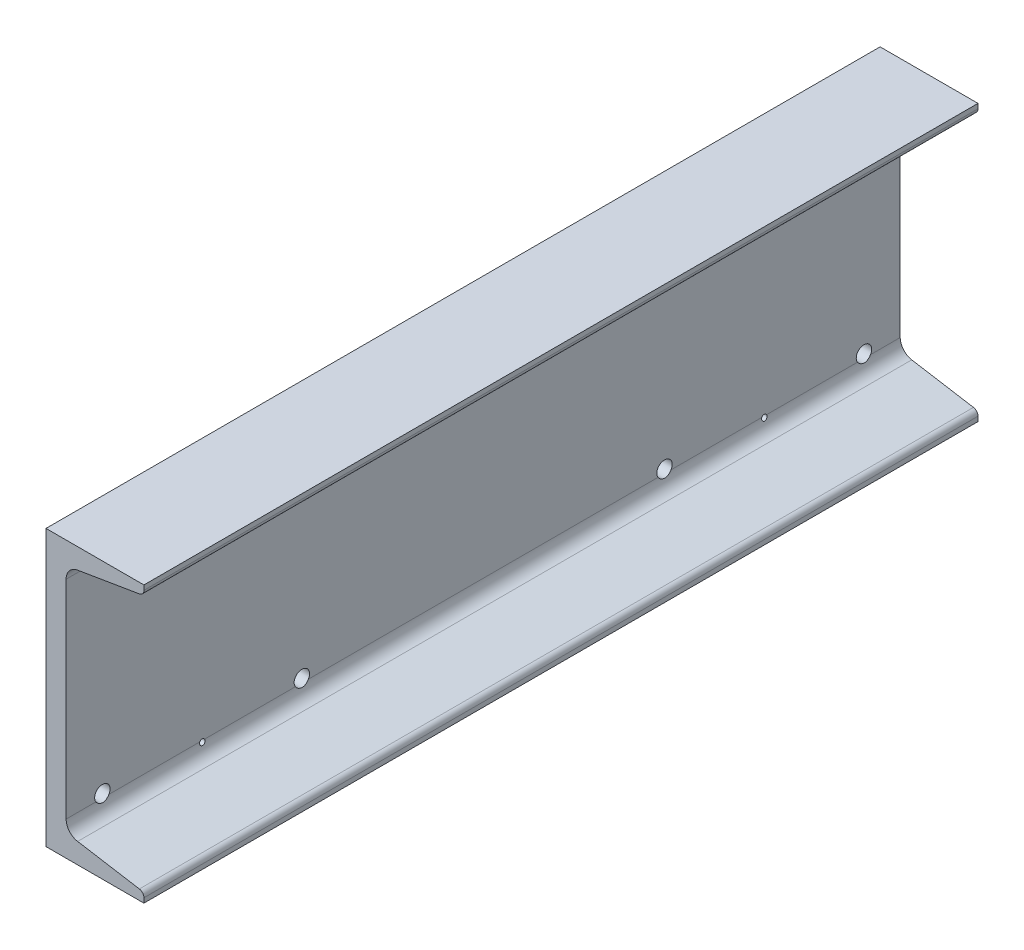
ISO-10303-21;
HEADER;
FILE_DESCRIPTION(('STEP AP214'),'2;1');
FILE_NAME('part.step','',(''),(''),'','','');
FILE_SCHEMA(('AUTOMOTIVE_DESIGN { 1 0 10303 214 1 1 1 1 }'));
ENDSEC;
DATA;
#1=APPLICATION_CONTEXT('core data for automotive mechanical design processes');
#2=APPLICATION_PROTOCOL_DEFINITION('international standard','automotive_design',2000,#1);
#3=PRODUCT_CONTEXT('',#1,'mechanical');
#4=PRODUCT('Part','Part','',(#3));
#5=PRODUCT_RELATED_PRODUCT_CATEGORY('part','',(#4));
#6=PRODUCT_DEFINITION_FORMATION('','',#4);
#7=PRODUCT_DEFINITION_CONTEXT('part definition',#1,'design');
#8=PRODUCT_DEFINITION('design','',#6,#7);
#9=PRODUCT_DEFINITION_SHAPE('','',#8);
#10=(LENGTH_UNIT() NAMED_UNIT(*) SI_UNIT(.MILLI.,.METRE.));
#11=(NAMED_UNIT(*) PLANE_ANGLE_UNIT() SI_UNIT($,.RADIAN.));
#12=(NAMED_UNIT(*) SI_UNIT($,.STERADIAN.) SOLID_ANGLE_UNIT());
#13=UNCERTAINTY_MEASURE_WITH_UNIT(LENGTH_MEASURE(1.E-05),#10,'distance_accuracy_value','');
#14=(GEOMETRIC_REPRESENTATION_CONTEXT(3) GLOBAL_UNCERTAINTY_ASSIGNED_CONTEXT((#13)) GLOBAL_UNIT_ASSIGNED_CONTEXT((#10,
#11,#12)) REPRESENTATION_CONTEXT('',''));
#15=CARTESIAN_POINT('',(0.,0.,0.));
#16=DIRECTION('',(0.,0.,1.));
#17=DIRECTION('',(1.,0.,0.));
#18=AXIS2_PLACEMENT_3D('',#15,#16,#17);
#19=CARTESIAN_POINT('',(0.,152.,230.));
#20=DIRECTION('',(1.,0.,0.));
#21=DIRECTION('',(0.,1.,0.));
#22=AXIS2_PLACEMENT_3D('',#19,#20,#21);
#23=PLANE('',#22);
#24=CARTESIAN_POINT('',(0.,18.,-155.));
#25=DIRECTION('',(1.,0.,0.));
#26=DIRECTION('',(0.,-1.,0.));
#27=AXIS2_PLACEMENT_3D('',#24,#25,#26);
#28=CIRCLE('',#27,1.5);
#29=CARTESIAN_POINT('',(0.,16.5,-155.));
#30=VERTEX_POINT('',#29);
#31=EDGE_CURVE('E203',#30,#30,#28,.T.);
#32=ORIENTED_EDGE('',*,*,#31,.T.);
#33=EDGE_LOOP('',(#32));
#34=FACE_BOUND('',#33,.T.);
#35=CARTESIAN_POINT('',(0.,134.,155.));
#36=DIRECTION('',(-1.,0.,0.));
#37=DIRECTION('',(0.,-1.,0.));
#38=AXIS2_PLACEMENT_3D('',#35,#36,#37);
#39=CIRCLE('',#38,1.5);
#40=CARTESIAN_POINT('',(0.,132.5,155.));
#41=VERTEX_POINT('',#40);
#42=EDGE_CURVE('E518',#41,#41,#39,.T.);
#43=ORIENTED_EDGE('',*,*,#42,.F.);
#44=EDGE_LOOP('',(#43));
#45=FACE_BOUND('',#44,.T.);
#46=CARTESIAN_POINT('',(0.,18.,155.));
#47=DIRECTION('',(-1.,0.,0.));
#48=DIRECTION('',(0.,-1.,0.));
#49=AXIS2_PLACEMENT_3D('',#46,#47,#48);
#50=CIRCLE('',#49,1.5);
#51=CARTESIAN_POINT('',(0.,16.5,155.));
#52=VERTEX_POINT('',#51);
#53=EDGE_CURVE('E353',#52,#52,#50,.T.);
#54=ORIENTED_EDGE('',*,*,#53,.F.);
#55=EDGE_LOOP('',(#54));
#56=FACE_BOUND('',#55,.T.);
#57=CARTESIAN_POINT('',(0.,21.,100.));
#58=DIRECTION('',(-1.,0.,0.));
#59=DIRECTION('',(0.,0.,1.));
#60=AXIS2_PLACEMENT_3D('',#57,#58,#59);
#61=CIRCLE('',#60,4.24999999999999);
#62=CARTESIAN_POINT('',(0.,21.,104.25));
#63=VERTEX_POINT('',#62);
#64=EDGE_CURVE('E352',#63,#63,#61,.T.);
#65=ORIENTED_EDGE('',*,*,#64,.F.);
#66=EDGE_LOOP('',(#65));
#67=FACE_BOUND('',#66,.T.);
#68=CARTESIAN_POINT('',(0.,131.,100.));
#69=DIRECTION('',(-1.,0.,0.));
#70=DIRECTION('',(0.,0.,1.));
#71=AXIS2_PLACEMENT_3D('',#68,#69,#70);
#72=CIRCLE('',#71,4.24999999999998);
#73=CARTESIAN_POINT('',(0.,131.,104.25));
#74=VERTEX_POINT('',#73);
#75=EDGE_CURVE('E246',#74,#74,#72,.T.);
#76=ORIENTED_EDGE('',*,*,#75,.F.);
#77=EDGE_LOOP('',(#76));
#78=FACE_BOUND('',#77,.T.);
#79=CARTESIAN_POINT('',(0.,131.,210.));
#80=DIRECTION('',(-1.,0.,0.));
#81=DIRECTION('',(0.,0.,1.));
#82=AXIS2_PLACEMENT_3D('',#79,#80,#81);
#83=CIRCLE('',#82,4.24999999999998);
#84=CARTESIAN_POINT('',(0.,131.,214.25));
#85=VERTEX_POINT('',#84);
#86=EDGE_CURVE('E245',#85,#85,#83,.T.);
#87=ORIENTED_EDGE('',*,*,#86,.F.);
#88=EDGE_LOOP('',(#87));
#89=FACE_BOUND('',#88,.T.);
#90=CARTESIAN_POINT('',(0.,21.,210.));
#91=DIRECTION('',(-1.,0.,0.));
#92=DIRECTION('',(0.,0.,1.));
#93=AXIS2_PLACEMENT_3D('',#90,#91,#92);
#94=CIRCLE('',#93,4.24999999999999);
#95=CARTESIAN_POINT('',(0.,21.,214.25));
#96=VERTEX_POINT('',#95);
#97=EDGE_CURVE('E257',#96,#96,#94,.T.);
#98=ORIENTED_EDGE('',*,*,#97,.F.);
#99=EDGE_LOOP('',(#98));
#100=FACE_BOUND('',#99,.T.);
#101=CARTESIAN_POINT('',(0.,21.,-210.));
#102=DIRECTION('',(-1.,0.,0.));
#103=DIRECTION('',(0.,0.,1.));
#104=AXIS2_PLACEMENT_3D('',#101,#102,#103);
#105=CIRCLE('',#104,4.24999999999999);
#106=CARTESIAN_POINT('',(0.,21.,-205.75));
#107=VERTEX_POINT('',#106);
#108=EDGE_CURVE('E267',#107,#107,#105,.T.);
#109=ORIENTED_EDGE('',*,*,#108,.F.);
#110=EDGE_LOOP('',(#109));
#111=FACE_BOUND('',#110,.T.);
#112=CARTESIAN_POINT('',(0.,131.,-210.));
#113=DIRECTION('',(-1.,0.,0.));
#114=DIRECTION('',(0.,0.,1.));
#115=AXIS2_PLACEMENT_3D('',#112,#113,#114);
#116=CIRCLE('',#115,4.24999999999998);
#117=CARTESIAN_POINT('',(0.,131.,-205.75));
#118=VERTEX_POINT('',#117);
#119=EDGE_CURVE('E395',#118,#118,#116,.T.);
#120=ORIENTED_EDGE('',*,*,#119,.F.);
#121=EDGE_LOOP('',(#120));
#122=FACE_BOUND('',#121,.T.);
#123=CARTESIAN_POINT('',(0.,131.,-100.));
#124=DIRECTION('',(-1.,0.,0.));
#125=DIRECTION('',(0.,0.,1.));
#126=AXIS2_PLACEMENT_3D('',#123,#124,#125);
#127=CIRCLE('',#126,4.24999999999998);
#128=CARTESIAN_POINT('',(0.,131.,-95.7500000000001));
#129=VERTEX_POINT('',#128);
#130=EDGE_CURVE('E539',#129,#129,#127,.T.);
#131=ORIENTED_EDGE('',*,*,#130,.F.);
#132=EDGE_LOOP('',(#131));
#133=FACE_BOUND('',#132,.T.);
#134=CARTESIAN_POINT('',(0.,21.,-100.));
#135=DIRECTION('',(-1.,0.,0.));
#136=DIRECTION('',(0.,0.,1.));
#137=AXIS2_PLACEMENT_3D('',#134,#135,#136);
#138=CIRCLE('',#137,4.24999999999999);
#139=CARTESIAN_POINT('',(0.,21.,-95.7500000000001));
#140=VERTEX_POINT('',#139);
#141=EDGE_CURVE('E543',#140,#140,#138,.T.);
#142=ORIENTED_EDGE('',*,*,#141,.F.);
#143=EDGE_LOOP('',(#142));
#144=FACE_BOUND('',#143,.T.);
#145=DIRECTION('',(0.,-1.,0.));
#146=VECTOR('',#145,1.);
#147=CARTESIAN_POINT('',(0.,152.,-230.));
#148=LINE('',#147,#146);
#149=CARTESIAN_POINT('',(0.,152.,-230.));
#150=VERTEX_POINT('',#149);
#151=CARTESIAN_POINT('',(0.,0.,-230.));
#152=VERTEX_POINT('',#151);
#153=EDGE_CURVE('E461',#150,#152,#148,.T.);
#154=ORIENTED_EDGE('',*,*,#153,.T.);
#155=DIRECTION('',(0.,0.,-1.));
#156=VECTOR('',#155,1.);
#157=CARTESIAN_POINT('',(0.,0.,230.));
#158=LINE('',#157,#156);
#159=CARTESIAN_POINT('',(0.,0.,230.));
#160=VERTEX_POINT('',#159);
#161=EDGE_CURVE('E652',#160,#152,#158,.T.);
#162=ORIENTED_EDGE('',*,*,#161,.F.);
#163=DIRECTION('',(0.,-1.,0.));
#164=VECTOR('',#163,1.);
#165=CARTESIAN_POINT('',(0.,152.,230.));
#166=LINE('',#165,#164);
#167=CARTESIAN_POINT('',(0.,152.,230.));
#168=VERTEX_POINT('',#167);
#169=EDGE_CURVE('E418',#168,#160,#166,.T.);
#170=ORIENTED_EDGE('',*,*,#169,.F.);
#171=DIRECTION('',(0.,0.,-1.));
#172=VECTOR('',#171,1.);
#173=CARTESIAN_POINT('',(0.,152.,230.));
#174=LINE('',#173,#172);
#175=EDGE_CURVE('E445',#168,#150,#174,.T.);
#176=ORIENTED_EDGE('',*,*,#175,.T.);
#177=EDGE_LOOP('',(#154,#162,#170,#176));
#178=FACE_BOUND('',#177,.T.);
#179=CARTESIAN_POINT('',(0.,134.,-155.));
#180=DIRECTION('',(1.,0.,0.));
#181=DIRECTION('',(0.,-1.,0.));
#182=AXIS2_PLACEMENT_3D('',#179,#180,#181);
#183=CIRCLE('',#182,1.5);
#184=CARTESIAN_POINT('',(0.,132.5,-155.));
#185=VERTEX_POINT('',#184);
#186=EDGE_CURVE('E204',#185,#185,#183,.T.);
#187=ORIENTED_EDGE('',*,*,#186,.T.);
#188=EDGE_LOOP('',(#187));
#189=FACE_BOUND('',#188,.T.);
#190=ADVANCED_FACE('F31',(#34,#45,#56,#67,#78,#89,#100,#111,#122,#133,#144,#178,#189),#23,.F.);
#191=CARTESIAN_POINT('',(11.1,133.286650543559,230.));
#192=DIRECTION('',(1.,0.,0.));
#193=DIRECTION('',(0.,1.,0.));
#194=AXIS2_PLACEMENT_3D('',#191,#192,#193);
#195=PLANE('',#194);
#196=DIRECTION('',(0.,0.,-1.));
#197=VECTOR('',#196,1.);
#198=CARTESIAN_POINT('',(11.1,133.286650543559,230.));
#199=LINE('',#198,#197);
#200=CARTESIAN_POINT('',(11.1,133.286650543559,-156.319519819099));
#201=VERTEX_POINT('',#200);
#202=CARTESIAN_POINT('',(11.1,133.286650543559,-206.417580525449));
#203=VERTEX_POINT('',#202);
#204=EDGE_CURVE('E202',#201,#203,#199,.T.);
#205=ORIENTED_EDGE('',*,*,#204,.F.);
#206=CARTESIAN_POINT('',(11.1,134.,-155.));
#207=DIRECTION('',(1.,0.,0.));
#208=DIRECTION('',(0.,1.,0.));
#209=AXIS2_PLACEMENT_3D('',#206,#207,#208);
#210=CIRCLE('',#209,1.5);
#211=CARTESIAN_POINT('',(11.1,133.286650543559,-153.680480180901));
#212=VERTEX_POINT('',#211);
#213=EDGE_CURVE('E47',#201,#212,#210,.F.);
#214=ORIENTED_EDGE('',*,*,#213,.T.);
#215=CARTESIAN_POINT('',(11.1,133.286650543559,-103.582419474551));
#216=VERTEX_POINT('',#215);
#217=EDGE_CURVE('E200',#216,#212,#199,.T.);
#218=ORIENTED_EDGE('',*,*,#217,.F.);
#219=CARTESIAN_POINT('',(11.1,131.,-100.));
#220=DIRECTION('',(1.,0.,0.));
#221=DIRECTION('',(0.,1.,0.));
#222=AXIS2_PLACEMENT_3D('',#219,#220,#221);
#223=CIRCLE('',#222,4.24999999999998);
#224=CARTESIAN_POINT('',(11.1,133.286650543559,-96.4175805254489));
#225=VERTEX_POINT('',#224);
#226=EDGE_CURVE('E581',#225,#216,#223,.T.);
#227=ORIENTED_EDGE('',*,*,#226,.F.);
#228=CARTESIAN_POINT('',(11.1,133.286650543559,96.4175805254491));
#229=VERTEX_POINT('',#228);
#230=EDGE_CURVE('E210',#229,#225,#199,.T.);
#231=ORIENTED_EDGE('',*,*,#230,.F.);
#232=CARTESIAN_POINT('',(11.1,131.,100.));
#233=DIRECTION('',(1.,0.,0.));
#234=DIRECTION('',(0.,1.,0.));
#235=AXIS2_PLACEMENT_3D('',#232,#233,#234);
#236=CIRCLE('',#235,4.24999999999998);
#237=CARTESIAN_POINT('',(11.1,133.286650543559,103.582419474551));
#238=VERTEX_POINT('',#237);
#239=EDGE_CURVE('E241',#238,#229,#236,.T.);
#240=ORIENTED_EDGE('',*,*,#239,.F.);
#241=CARTESIAN_POINT('',(11.1,133.286650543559,153.680480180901));
#242=VERTEX_POINT('',#241);
#243=EDGE_CURVE('E214',#242,#238,#199,.T.);
#244=ORIENTED_EDGE('',*,*,#243,.F.);
#245=CARTESIAN_POINT('',(11.1,134.,155.));
#246=DIRECTION('',(1.,0.,0.));
#247=DIRECTION('',(0.,1.,0.));
#248=AXIS2_PLACEMENT_3D('',#245,#246,#247);
#249=CIRCLE('',#248,1.5);
#250=CARTESIAN_POINT('',(11.1,133.286650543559,156.319519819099));
#251=VERTEX_POINT('',#250);
#252=EDGE_CURVE('E554',#251,#242,#249,.T.);
#253=ORIENTED_EDGE('',*,*,#252,.F.);
#254=CARTESIAN_POINT('',(11.1,133.286650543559,206.417580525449));
#255=VERTEX_POINT('',#254);
#256=EDGE_CURVE('E215',#255,#251,#199,.T.);
#257=ORIENTED_EDGE('',*,*,#256,.F.);
#258=CARTESIAN_POINT('',(11.1,131.,210.));
#259=DIRECTION('',(1.,0.,0.));
#260=DIRECTION('',(0.,1.,0.));
#261=AXIS2_PLACEMENT_3D('',#258,#259,#260);
#262=CIRCLE('',#261,4.24999999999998);
#263=CARTESIAN_POINT('',(11.1,133.286650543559,213.582419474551));
#264=VERTEX_POINT('',#263);
#265=EDGE_CURVE('E249',#264,#255,#262,.T.);
#266=ORIENTED_EDGE('',*,*,#265,.F.);
#267=CARTESIAN_POINT('',(11.1,133.286650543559,230.));
#268=VERTEX_POINT('',#267);
#269=EDGE_CURVE('E212',#268,#264,#199,.T.);
#270=ORIENTED_EDGE('',*,*,#269,.F.);
#271=DIRECTION('',(0.,-1.,0.));
#272=VECTOR('',#271,1.);
#273=CARTESIAN_POINT('',(11.1,133.286650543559,230.));
#274=LINE('',#273,#272);
#275=CARTESIAN_POINT('',(11.1,18.7133494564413,230.));
#276=VERTEX_POINT('',#275);
#277=EDGE_CURVE('E432',#268,#276,#274,.T.);
#278=ORIENTED_EDGE('',*,*,#277,.T.);
#279=DIRECTION('',(0.,0.,-1.));
#280=VECTOR('',#279,1.);
#281=CARTESIAN_POINT('',(11.1,18.7133494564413,230.));
#282=LINE('',#281,#280);
#283=CARTESIAN_POINT('',(11.1,18.7133494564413,213.582419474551));
#284=VERTEX_POINT('',#283);
#285=EDGE_CURVE('E380',#276,#284,#282,.T.);
#286=ORIENTED_EDGE('',*,*,#285,.T.);
#287=CARTESIAN_POINT('',(11.1,21.,210.));
#288=DIRECTION('',(1.,0.,0.));
#289=DIRECTION('',(0.,1.,0.));
#290=AXIS2_PLACEMENT_3D('',#287,#288,#289);
#291=CIRCLE('',#290,4.24999999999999);
#292=CARTESIAN_POINT('',(11.1,18.7133494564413,206.417580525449));
#293=VERTEX_POINT('',#292);
#294=EDGE_CURVE('E297',#293,#284,#291,.T.);
#295=ORIENTED_EDGE('',*,*,#294,.F.);
#296=CARTESIAN_POINT('',(11.1,18.7133494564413,156.319519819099));
#297=VERTEX_POINT('',#296);
#298=EDGE_CURVE('E377',#293,#297,#282,.T.);
#299=ORIENTED_EDGE('',*,*,#298,.T.);
#300=CARTESIAN_POINT('',(11.1,18.,155.));
#301=DIRECTION('',(1.,0.,0.));
#302=DIRECTION('',(0.,1.,0.));
#303=AXIS2_PLACEMENT_3D('',#300,#301,#302);
#304=CIRCLE('',#303,1.5);
#305=CARTESIAN_POINT('',(11.1,18.7133494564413,153.680480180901));
#306=VERTEX_POINT('',#305);
#307=EDGE_CURVE('E330',#306,#297,#304,.T.);
#308=ORIENTED_EDGE('',*,*,#307,.F.);
#309=CARTESIAN_POINT('',(11.1,18.7133494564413,103.582419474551));
#310=VERTEX_POINT('',#309);
#311=EDGE_CURVE('E366',#306,#310,#282,.T.);
#312=ORIENTED_EDGE('',*,*,#311,.T.);
#313=CARTESIAN_POINT('',(11.1,21.,100.));
#314=DIRECTION('',(1.,0.,0.));
#315=DIRECTION('',(0.,1.,0.));
#316=AXIS2_PLACEMENT_3D('',#313,#314,#315);
#317=CIRCLE('',#316,4.24999999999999);
#318=CARTESIAN_POINT('',(11.1,18.7133494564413,96.4175805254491));
#319=VERTEX_POINT('',#318);
#320=EDGE_CURVE('E252',#319,#310,#317,.T.);
#321=ORIENTED_EDGE('',*,*,#320,.F.);
#322=CARTESIAN_POINT('',(11.1,18.7133494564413,-96.4175805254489));
#323=VERTEX_POINT('',#322);
#324=EDGE_CURVE('E368',#319,#323,#282,.T.);
#325=ORIENTED_EDGE('',*,*,#324,.T.);
#326=CARTESIAN_POINT('',(11.1,21.,-100.));
#327=DIRECTION('',(1.,0.,0.));
#328=DIRECTION('',(0.,1.,0.));
#329=AXIS2_PLACEMENT_3D('',#326,#327,#328);
#330=CIRCLE('',#329,4.24999999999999);
#331=CARTESIAN_POINT('',(11.1,18.7133494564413,-103.582419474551));
#332=VERTEX_POINT('',#331);
#333=EDGE_CURVE('E578',#332,#323,#330,.T.);
#334=ORIENTED_EDGE('',*,*,#333,.F.);
#335=CARTESIAN_POINT('',(11.1,18.7133494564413,-153.680480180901));
#336=VERTEX_POINT('',#335);
#337=EDGE_CURVE('E383',#332,#336,#282,.T.);
#338=ORIENTED_EDGE('',*,*,#337,.T.);
#339=CARTESIAN_POINT('',(11.1,18.,-155.));
#340=DIRECTION('',(1.,0.,0.));
#341=DIRECTION('',(0.,1.,0.));
#342=AXIS2_PLACEMENT_3D('',#339,#340,#341);
#343=CIRCLE('',#342,1.5);
#344=CARTESIAN_POINT('',(11.1,18.7133494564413,-156.319519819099));
#345=VERTEX_POINT('',#344);
#346=EDGE_CURVE('E42',#336,#345,#343,.F.);
#347=ORIENTED_EDGE('',*,*,#346,.T.);
#348=CARTESIAN_POINT('',(11.1,18.7133494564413,-206.417580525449));
#349=VERTEX_POINT('',#348);
#350=EDGE_CURVE('E382',#345,#349,#282,.T.);
#351=ORIENTED_EDGE('',*,*,#350,.T.);
#352=CARTESIAN_POINT('',(11.1,21.,-210.));
#353=DIRECTION('',(1.,0.,0.));
#354=DIRECTION('',(0.,1.,0.));
#355=AXIS2_PLACEMENT_3D('',#352,#353,#354);
#356=CIRCLE('',#355,4.24999999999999);
#357=CARTESIAN_POINT('',(11.1,18.7133494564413,-213.582419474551));
#358=VERTEX_POINT('',#357);
#359=EDGE_CURVE('E391',#358,#349,#356,.T.);
#360=ORIENTED_EDGE('',*,*,#359,.F.);
#361=CARTESIAN_POINT('',(11.1,18.7133494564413,-230.));
#362=VERTEX_POINT('',#361);
#363=EDGE_CURVE('E219',#358,#362,#282,.T.);
#364=ORIENTED_EDGE('',*,*,#363,.T.);
#365=DIRECTION('',(0.,-1.,0.));
#366=VECTOR('',#365,1.);
#367=CARTESIAN_POINT('',(11.1,133.286650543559,-230.));
#368=LINE('',#367,#366);
#369=CARTESIAN_POINT('',(11.1,133.286650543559,-230.));
#370=VERTEX_POINT('',#369);
#371=EDGE_CURVE('E401',#370,#362,#368,.T.);
#372=ORIENTED_EDGE('',*,*,#371,.F.);
#373=CARTESIAN_POINT('',(11.1,133.286650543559,-213.582419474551));
#374=VERTEX_POINT('',#373);
#375=EDGE_CURVE('E213',#374,#370,#199,.T.);
#376=ORIENTED_EDGE('',*,*,#375,.F.);
#377=CARTESIAN_POINT('',(11.1,131.,-210.));
#378=DIRECTION('',(1.,0.,0.));
#379=DIRECTION('',(0.,1.,0.));
#380=AXIS2_PLACEMENT_3D('',#377,#378,#379);
#381=CIRCLE('',#380,4.24999999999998);
#382=EDGE_CURVE('E584',#203,#374,#381,.T.);
#383=ORIENTED_EDGE('',*,*,#382,.F.);
#384=EDGE_LOOP('',(#205,#214,#218,#227,#231,#240,#244,#253,#257,#266,#270,#278,#286,#295,#299,
#308,#312,#321,#325,#334,#338,#347,#351,#360,#364,#372,#376,#383));
#385=FACE_BOUND('',#384,.T.);
#386=ADVANCED_FACE('F198',(#385),#195,.T.);
#387=CARTESIAN_POINT('',(18.7,133.286650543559,230.));
#388=DIRECTION('',(0.,0.,-1.));
#389=DIRECTION('',(-1.,0.,0.));
#390=AXIS2_PLACEMENT_3D('',#387,#388,#389);
#391=CYLINDRICAL_SURFACE('',#390,7.59999999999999);
#392=CARTESIAN_POINT('',(11.1,133.286650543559,-153.680480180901));
#393=CARTESIAN_POINT('',(11.1000006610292,133.21269222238,-153.720466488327));
#394=CARTESIAN_POINT('',(11.1010875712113,133.142067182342,-153.766705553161));
#395=CARTESIAN_POINT('',(11.1047630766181,133.009540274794,-153.870362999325));
#396=CARTESIAN_POINT('',(11.1073530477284,132.94764646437,-153.92779159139));
#397=CARTESIAN_POINT('',(11.1132558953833,132.834397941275,-154.052140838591));
#398=CARTESIAN_POINT('',(11.1165682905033,132.783036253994,-154.119055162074));
#399=CARTESIAN_POINT('',(11.1231433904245,132.692240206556,-154.260521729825));
#400=CARTESIAN_POINT('',(11.1264061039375,132.652803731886,-154.335072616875));
#401=CARTESIAN_POINT('',(11.1322171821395,132.586814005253,-154.490069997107));
#402=CARTESIAN_POINT('',(11.1347625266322,132.560314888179,-154.570539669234));
#403=CARTESIAN_POINT('',(11.1386179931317,132.521214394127,-154.734817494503));
#404=CARTESIAN_POINT('',(11.1399281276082,132.508612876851,-154.818625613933));
#405=CARTESIAN_POINT('',(11.1410589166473,132.497701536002,-154.986832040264));
#406=CARTESIAN_POINT('',(11.1408856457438,132.499333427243,-155.071226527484));
#407=CARTESIAN_POINT('',(11.1390970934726,132.516701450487,-155.238534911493));
#408=CARTESIAN_POINT('',(11.1374818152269,132.532437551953,-155.321448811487));
#409=CARTESIAN_POINT('',(11.1331230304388,132.577510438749,-155.483286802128));
#410=CARTESIAN_POINT('',(11.13038170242,132.606820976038,-155.562218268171));
#411=CARTESIAN_POINT('',(11.1243109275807,132.678200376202,-155.71406185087));
#412=CARTESIAN_POINT('',(11.1209814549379,132.720269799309,-155.786973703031));
#413=CARTESIAN_POINT('',(11.114419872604,132.816234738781,-155.925098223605));
#414=CARTESIAN_POINT('',(11.1111883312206,132.87018818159,-155.990270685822));
#415=CARTESIAN_POINT('',(11.105629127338,132.988292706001,-156.110656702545));
#416=CARTESIAN_POINT('',(11.1033014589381,133.052443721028,-156.165870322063));
#417=CARTESIAN_POINT('',(11.1003202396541,133.189064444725,-156.264707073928));
#418=CARTESIAN_POINT('',(11.0996649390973,133.261525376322,-156.308342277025));
#419=CARTESIAN_POINT('',(11.1006703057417,133.412727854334,-156.38282763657));
#420=CARTESIAN_POINT('',(11.102330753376,133.491468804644,-156.413679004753));
#421=CARTESIAN_POINT('',(11.1083669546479,133.652004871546,-156.461449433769));
#422=CARTESIAN_POINT('',(11.1127120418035,133.733755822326,-156.478520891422));
#423=CARTESIAN_POINT('',(11.1242383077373,133.898755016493,-156.498885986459));
#424=CARTESIAN_POINT('',(11.1314193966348,133.982003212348,-156.50218006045));
#425=CARTESIAN_POINT('',(11.1484403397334,134.147369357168,-156.49502910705));
#426=CARTESIAN_POINT('',(11.1582720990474,134.229489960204,-156.484625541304));
#427=CARTESIAN_POINT('',(11.1801695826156,134.390628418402,-156.450583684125));
#428=CARTESIAN_POINT('',(11.1922355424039,134.469645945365,-156.426943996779));
#429=CARTESIAN_POINT('',(11.2181659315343,134.623960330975,-156.366624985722));
#430=CARTESIAN_POINT('',(11.2320596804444,134.699160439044,-156.329710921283));
#431=CARTESIAN_POINT('',(11.2605584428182,134.842299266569,-156.243983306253));
#432=CARTESIAN_POINT('',(11.2751635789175,134.910236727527,-156.195167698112));
#433=CARTESIAN_POINT('',(11.304381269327,135.038580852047,-156.085646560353));
#434=CARTESIAN_POINT('',(11.3189862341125,135.09877782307,-156.024692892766));
#435=CARTESIAN_POINT('',(11.3466804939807,135.208076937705,-155.893228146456));
#436=CARTESIAN_POINT('',(11.3597697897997,135.257179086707,-155.822717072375));
#437=CARTESIAN_POINT('',(11.3832208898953,135.342544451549,-155.674426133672));
#438=CARTESIAN_POINT('',(11.3935977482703,135.378878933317,-155.596689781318));
#439=CARTESIAN_POINT('',(11.4107401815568,135.437846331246,-155.435811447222));
#440=CARTESIAN_POINT('',(11.4175067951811,135.460483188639,-155.35267102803));
#441=CARTESIAN_POINT('',(11.4265786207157,135.490642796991,-155.186648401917));
#442=CARTESIAN_POINT('',(11.4290397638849,135.498694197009,-155.103870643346));
#443=CARTESIAN_POINT('',(11.4297451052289,135.501012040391,-154.938111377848));
#444=CARTESIAN_POINT('',(11.4279899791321,135.495280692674,-154.855129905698));
#445=CARTESIAN_POINT('',(11.4205313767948,135.470567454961,-154.693484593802));
#446=CARTESIAN_POINT('',(11.4149273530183,135.451919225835,-154.614764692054));
#447=CARTESIAN_POINT('',(11.4003819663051,135.402362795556,-154.461615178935));
#448=CARTESIAN_POINT('',(11.3914402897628,135.37145344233,-154.387185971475));
#449=CARTESIAN_POINT('',(11.3707882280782,135.29765602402,-154.243194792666));
#450=CARTESIAN_POINT('',(11.3590300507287,135.254558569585,-154.173747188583));
#451=CARTESIAN_POINT('',(11.3337908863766,135.157867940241,-154.042941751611));
#452=CARTESIAN_POINT('',(11.3203095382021,135.104272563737,-153.981585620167));
#453=CARTESIAN_POINT('',(11.2920995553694,134.98572582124,-153.866225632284));
#454=CARTESIAN_POINT('',(11.2773428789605,134.920416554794,-153.81259601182));
#455=CARTESIAN_POINT('',(11.2481610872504,134.781681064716,-153.717006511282));
#456=CARTESIAN_POINT('',(11.2337360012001,134.708254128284,-153.675047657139));
#457=CARTESIAN_POINT('',(11.2060048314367,134.554033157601,-153.60343946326));
#458=CARTESIAN_POINT('',(11.1927188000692,134.473145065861,-153.573984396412));
#459=CARTESIAN_POINT('',(11.1683660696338,134.307197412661,-153.529281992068));
#460=CARTESIAN_POINT('',(11.1572994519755,134.222137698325,-153.514035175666));
#461=CARTESIAN_POINT('',(11.1381513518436,134.05192673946,-153.498509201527));
#462=CARTESIAN_POINT('',(11.1300188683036,133.966805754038,-153.497960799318));
#463=CARTESIAN_POINT('',(11.1167155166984,133.797520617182,-153.511310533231));
#464=CARTESIAN_POINT('',(11.1115418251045,133.713355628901,-153.525194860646));
#465=CARTESIAN_POINT('',(11.1050882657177,133.571122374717,-153.561291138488));
#466=CARTESIAN_POINT('',(11.1031301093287,133.512218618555,-153.58018193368));
#467=CARTESIAN_POINT('',(11.1005857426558,133.397159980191,-153.625082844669));
#468=CARTESIAN_POINT('',(11.0999995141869,133.341005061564,-153.651092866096));
#469=CARTESIAN_POINT('',(11.1,133.286650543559,-153.680480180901));
#470=B_SPLINE_CURVE_WITH_KNOTS('',3,(#392,#393,#394,#395,#396,#397,#398,#399,#400,#401,#402,
#403,#404,#405,#406,#407,#408,#409,#410,#411,#412,#413,#414,#415,#416,#417,#418,#419,#420,#421,
#422,#423,#424,#425,#426,#427,#428,#429,#430,#431,#432,#433,#434,#435,#436,#437,#438,#439,#440,
#441,#442,#443,#444,#445,#446,#447,#448,#449,#450,#451,#452,#453,#454,#455,#456,#457,#458,#459,
#460,#461,#462,#463,#464,#465,#466,#467,#468,#469),.UNSPECIFIED.,.T.,.F.,(4,2,2,2,2,2,2,2,2,2,2,
2,2,2,2,2,2,2,2,2,2,2,2,2,2,2,2,2,2,2,2,2,2,2,2,2,2,2,4),(0.,0.252001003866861,0.50423305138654,
0.756297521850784,1.00831727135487,1.26138271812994,1.51444561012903,1.76647270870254,
2.01849926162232,2.27004050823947,2.52159280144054,2.77439949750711,3.02720454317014,
3.27974498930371,3.53226149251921,3.7819455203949,4.03162163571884,4.28054373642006,
4.52949209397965,4.7830787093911,5.0367091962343,5.29618615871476,5.55566299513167,
5.81366758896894,6.07159791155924,6.31997680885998,6.5683159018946,6.81046825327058,
7.05264336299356,7.29926211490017,7.54593264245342,7.80210464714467,8.05829916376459,
8.31834017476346,8.57839072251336,8.8336743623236,9.0887139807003,9.27392065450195,
9.45912487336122),.UNSPECIFIED.);
#471=EDGE_CURVE('E11',#201,#212,#470,.T.);
#472=ORIENTED_EDGE('',*,*,#471,.F.);
#473=ORIENTED_EDGE('',*,*,#204,.T.);
#474=CARTESIAN_POINT('',(11.1,133.286650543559,-206.417580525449));
#475=CARTESIAN_POINT('',(11.0999916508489,133.386151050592,-206.4810745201));
#476=CARTESIAN_POINT('',(11.1019538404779,133.482966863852,-206.548721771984));
#477=CARTESIAN_POINT('',(11.109123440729,133.670529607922,-206.691731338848));
#478=CARTESIAN_POINT('',(11.1143293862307,133.761279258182,-206.767090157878));
#479=CARTESIAN_POINT('',(11.1272809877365,133.935954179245,-206.924856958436));
#480=CARTESIAN_POINT('',(11.1350223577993,134.019890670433,-207.007252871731));
#481=CARTESIAN_POINT('',(11.1523209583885,134.180557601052,-207.178588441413));
#482=CARTESIAN_POINT('',(11.1618783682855,134.25728732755,-207.267528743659));
#483=CARTESIAN_POINT('',(11.1921621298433,134.475757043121,-207.543088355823));
#484=CARTESIAN_POINT('',(11.2145308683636,134.606121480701,-207.738757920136));
#485=CARTESIAN_POINT('',(11.2580538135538,134.832885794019,-208.148922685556));
#486=CARTESIAN_POINT('',(11.2792077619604,134.929278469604,-208.363421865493));
#487=CARTESIAN_POINT('',(11.3159400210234,135.087328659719,-208.810974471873));
#488=CARTESIAN_POINT('',(11.331379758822,135.148141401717,-209.044340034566));
#489=CARTESIAN_POINT('',(11.3523958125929,135.229464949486,-209.518401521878));
#490=CARTESIAN_POINT('',(11.3579745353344,135.249985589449,-209.75909564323));
#491=CARTESIAN_POINT('',(11.3579851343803,135.250013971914,-210.233324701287));
#492=CARTESIAN_POINT('',(11.3527424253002,135.230719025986,-210.466860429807));
#493=CARTESIAN_POINT('',(11.3329205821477,135.154181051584,-210.927216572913));
#494=CARTESIAN_POINT('',(11.318340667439,135.096934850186,-211.154036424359));
#495=CARTESIAN_POINT('',(11.2830707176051,134.946492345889,-211.59428651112));
#496=CARTESIAN_POINT('',(11.262393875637,134.853373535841,-211.807744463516));
#497=CARTESIAN_POINT('',(11.2194787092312,134.633597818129,-212.216589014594));
#498=CARTESIAN_POINT('',(11.1972403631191,134.506940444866,-212.411975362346));
#499=CARTESIAN_POINT('',(11.1662372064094,134.290683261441,-212.692368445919));
#500=CARTESIAN_POINT('',(11.1560817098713,134.211967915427,-212.785802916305));
#501=CARTESIAN_POINT('',(11.1376401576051,134.046670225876,-212.965670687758));
#502=CARTESIAN_POINT('',(11.1293539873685,133.960088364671,-213.052104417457));
#503=CARTESIAN_POINT('',(11.1154556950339,133.779491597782,-213.217442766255));
#504=CARTESIAN_POINT('',(11.1098489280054,133.685462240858,-213.296332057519));
#505=CARTESIAN_POINT('',(11.1021154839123,133.490810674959,-213.445789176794));
#506=CARTESIAN_POINT('',(11.0999903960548,133.390185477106,-213.516353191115));
#507=CARTESIAN_POINT('',(11.1,133.286650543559,-213.582419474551));
#508=B_SPLINE_CURVE_WITH_KNOTS('',3,(#474,#475,#476,#477,#478,#479,#480,#481,#482,#483,#484,
#485,#486,#487,#488,#489,#490,#491,#492,#493,#494,#495,#496,#497,#498,#499,#500,#501,#502,#503,
#504,#505,#506,#507),.UNSPECIFIED.,.F.,.F.,(4,2,2,2,2,2,2,2,2,2,2,2,2,2,2,2,4),(0.,
0.353937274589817,0.707714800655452,1.06089735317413,1.41411480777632,2.11917165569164,
2.82437784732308,3.54571142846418,4.26686893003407,4.96665644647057,5.66650247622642,
6.36484508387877,7.06319738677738,7.43059062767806,7.79796135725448,8.16606327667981,
8.5343331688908),.UNSPECIFIED.);
#509=EDGE_CURVE('E298',#203,#374,#508,.T.);
#510=ORIENTED_EDGE('',*,*,#509,.T.);
#511=ORIENTED_EDGE('',*,*,#375,.T.);
#512=CARTESIAN_POINT('',(18.7,133.286650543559,-230.));
#513=DIRECTION('',(0.,0.,-1.));
#514=DIRECTION('',(-1.,0.,0.));
#515=AXIS2_PLACEMENT_3D('',#512,#513,#514);
#516=CIRCLE('',#515,7.59999999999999);
#517=CARTESIAN_POINT('',(17.4504790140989,140.783229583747,-230.));
#518=VERTEX_POINT('',#517);
#519=EDGE_CURVE('E403',#370,#518,#516,.T.);
#520=ORIENTED_EDGE('',*,*,#519,.T.);
#521=DIRECTION('',(0.,0.,-1.));
#522=VECTOR('',#521,1.);
#523=CARTESIAN_POINT('',(17.4504790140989,140.783229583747,230.));
#524=LINE('',#523,#522);
#525=CARTESIAN_POINT('',(17.4504790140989,140.783229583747,230.));
#526=VERTEX_POINT('',#525);
#527=EDGE_CURVE('E220',#526,#518,#524,.T.);
#528=ORIENTED_EDGE('',*,*,#527,.F.);
#529=CARTESIAN_POINT('',(18.7,133.286650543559,230.));
#530=DIRECTION('',(0.,0.,-1.));
#531=DIRECTION('',(-1.,0.,0.));
#532=AXIS2_PLACEMENT_3D('',#529,#530,#531);
#533=CIRCLE('',#532,7.59999999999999);
#534=EDGE_CURVE('E435',#268,#526,#533,.T.);
#535=ORIENTED_EDGE('',*,*,#534,.F.);
#536=ORIENTED_EDGE('',*,*,#269,.T.);
#537=CARTESIAN_POINT('',(11.1,133.286650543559,213.582419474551));
#538=CARTESIAN_POINT('',(11.0999916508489,133.386151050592,213.5189254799));
#539=CARTESIAN_POINT('',(11.1019538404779,133.482966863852,213.451278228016));
#540=CARTESIAN_POINT('',(11.109123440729,133.670529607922,213.308268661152));
#541=CARTESIAN_POINT('',(11.1143293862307,133.761279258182,213.232909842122));
#542=CARTESIAN_POINT('',(11.1272809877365,133.935954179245,213.075143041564));
#543=CARTESIAN_POINT('',(11.1350223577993,134.019890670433,212.992747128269));
#544=CARTESIAN_POINT('',(11.1523209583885,134.180557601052,212.821411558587));
#545=CARTESIAN_POINT('',(11.1618783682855,134.25728732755,212.732471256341));
#546=CARTESIAN_POINT('',(11.1921621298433,134.475757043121,212.456911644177));
#547=CARTESIAN_POINT('',(11.2145308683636,134.606121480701,212.261242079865));
#548=CARTESIAN_POINT('',(11.2580538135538,134.832885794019,211.851077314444));
#549=CARTESIAN_POINT('',(11.2792077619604,134.929278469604,211.636578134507));
#550=CARTESIAN_POINT('',(11.3159400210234,135.087328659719,211.189025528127));
#551=CARTESIAN_POINT('',(11.331379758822,135.148141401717,210.955659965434));
#552=CARTESIAN_POINT('',(11.3523958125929,135.229464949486,210.481598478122));
#553=CARTESIAN_POINT('',(11.3579745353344,135.249985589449,210.24090435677));
#554=CARTESIAN_POINT('',(11.3579851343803,135.250013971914,209.766675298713));
#555=CARTESIAN_POINT('',(11.3527424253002,135.230719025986,209.533139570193));
#556=CARTESIAN_POINT('',(11.3329205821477,135.154181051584,209.072783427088));
#557=CARTESIAN_POINT('',(11.318340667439,135.096934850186,208.845963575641));
#558=CARTESIAN_POINT('',(11.2830707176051,134.946492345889,208.40571348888));
#559=CARTESIAN_POINT('',(11.262393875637,134.853373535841,208.192255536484));
#560=CARTESIAN_POINT('',(11.2194787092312,134.633597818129,207.783410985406));
#561=CARTESIAN_POINT('',(11.1972403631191,134.506940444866,207.588024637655));
#562=CARTESIAN_POINT('',(11.1662372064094,134.290683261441,207.307631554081));
#563=CARTESIAN_POINT('',(11.1560817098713,134.211967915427,207.214197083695));
#564=CARTESIAN_POINT('',(11.1376401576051,134.046670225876,207.034329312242));
#565=CARTESIAN_POINT('',(11.1293539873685,133.960088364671,206.947895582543));
#566=CARTESIAN_POINT('',(11.1154556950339,133.779491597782,206.782557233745));
#567=CARTESIAN_POINT('',(11.1098489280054,133.685462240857,206.703667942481));
#568=CARTESIAN_POINT('',(11.1021154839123,133.490810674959,206.554210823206));
#569=CARTESIAN_POINT('',(11.0999903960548,133.390185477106,206.483646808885));
#570=CARTESIAN_POINT('',(11.1,133.286650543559,206.417580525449));
#571=B_SPLINE_CURVE_WITH_KNOTS('',3,(#537,#538,#539,#540,#541,#542,#543,#544,#545,#546,#547,
#548,#549,#550,#551,#552,#553,#554,#555,#556,#557,#558,#559,#560,#561,#562,#563,#564,#565,#566,
#567,#568,#569,#570),.UNSPECIFIED.,.F.,.F.,(4,2,2,2,2,2,2,2,2,2,2,2,2,2,2,2,4),(0.,
0.353937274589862,0.707714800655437,1.06089735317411,1.4141148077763,2.11917165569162,
2.82437784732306,3.54571142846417,4.26686893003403,4.96665644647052,5.66650247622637,
6.36484508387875,7.06319738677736,7.43059062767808,7.79796135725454,8.16606327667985,
8.53433316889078),.UNSPECIFIED.);
#572=EDGE_CURVE('E243',#264,#255,#571,.T.);
#573=ORIENTED_EDGE('',*,*,#572,.T.);
#574=ORIENTED_EDGE('',*,*,#256,.T.);
#575=CARTESIAN_POINT('',(11.1,133.286650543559,156.319519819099));
#576=CARTESIAN_POINT('',(11.1000012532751,133.359725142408,156.359021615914));
#577=CARTESIAN_POINT('',(11.101063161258,133.436121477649,156.392456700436));
#578=CARTESIAN_POINT('',(11.1057837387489,133.593358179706,156.446220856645));
#579=CARTESIAN_POINT('',(11.1094440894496,133.674201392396,156.466541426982));
#580=CARTESIAN_POINT('',(11.1195774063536,133.837934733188,156.493524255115));
#581=CARTESIAN_POINT('',(11.1260493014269,133.920824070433,156.500191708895));
#582=CARTESIAN_POINT('',(11.1417278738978,134.086294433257,156.499799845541));
#583=CARTESIAN_POINT('',(11.1509342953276,134.16887548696,156.492741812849));
#584=CARTESIAN_POINT('',(11.1717591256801,134.331814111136,156.465181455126));
#585=CARTESIAN_POINT('',(11.1833877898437,134.412160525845,156.444621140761));
#586=CARTESIAN_POINT('',(11.2084032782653,134.568143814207,156.390692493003));
#587=CARTESIAN_POINT('',(11.2217903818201,134.643779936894,156.357322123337));
#588=CARTESIAN_POINT('',(11.2498240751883,134.790169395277,156.277785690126));
#589=CARTESIAN_POINT('',(11.2644931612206,134.860762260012,156.231332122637));
#590=CARTESIAN_POINT('',(11.2937631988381,134.993185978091,156.127242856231));
#591=CARTESIAN_POINT('',(11.3083641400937,135.055015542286,156.069605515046));
#592=CARTESIAN_POINT('',(11.3365940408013,135.169140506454,155.943633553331));
#593=CARTESIAN_POINT('',(11.3502043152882,135.221272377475,155.875146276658));
#594=CARTESIAN_POINT('',(11.3750228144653,135.313220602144,155.729953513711));
#595=CARTESIAN_POINT('',(11.3862313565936,135.353038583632,155.653249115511));
#596=CARTESIAN_POINT('',(11.4050048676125,135.418359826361,155.495382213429));
#597=CARTESIAN_POINT('',(11.4126389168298,135.444136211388,155.414341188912));
#598=CARTESIAN_POINT('',(11.4238498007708,135.481651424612,155.248807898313));
#599=CARTESIAN_POINT('',(11.4274278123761,135.493394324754,155.16431664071));
#600=CARTESIAN_POINT('',(11.4301135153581,135.502224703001,154.997785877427));
#601=CARTESIAN_POINT('',(11.4293885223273,135.499860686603,154.915777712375));
#602=CARTESIAN_POINT('',(11.4239277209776,135.481840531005,154.753378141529));
#603=CARTESIAN_POINT('',(11.4191921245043,135.466185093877,154.67298665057));
#604=CARTESIAN_POINT('',(11.4062132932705,135.422344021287,154.516828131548));
#605=CARTESIAN_POINT('',(11.3980033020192,135.394277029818,154.441024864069));
#606=CARTESIAN_POINT('',(11.3787911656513,135.326536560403,154.295181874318));
#607=CARTESIAN_POINT('',(11.3677885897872,135.286861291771,154.225143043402));
#608=CARTESIAN_POINT('',(11.343501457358,135.195634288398,154.090451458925));
#609=CARTESIAN_POINT('',(11.3301566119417,135.143751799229,154.026033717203));
#610=CARTESIAN_POINT('',(11.3024834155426,135.030254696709,153.906674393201));
#611=CARTESIAN_POINT('',(11.2881548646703,134.968638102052,153.85173474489));
#612=CARTESIAN_POINT('',(11.2590685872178,134.834993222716,153.750991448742));
#613=CARTESIAN_POINT('',(11.2443127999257,134.762682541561,153.705561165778));
#614=CARTESIAN_POINT('',(11.2159223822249,134.611230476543,153.627537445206));
#615=CARTESIAN_POINT('',(11.2022877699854,134.532088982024,153.594944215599));
#616=CARTESIAN_POINT('',(11.1770212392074,134.369052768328,153.543597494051));
#617=CARTESIAN_POINT('',(11.1653908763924,134.285154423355,153.524854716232));
#618=CARTESIAN_POINT('',(11.144799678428,134.115070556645,153.501961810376));
#619=CARTESIAN_POINT('',(11.1358384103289,134.028885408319,153.497809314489));
#620=CARTESIAN_POINT('',(11.1211082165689,133.858926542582,153.504288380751));
#621=CARTESIAN_POINT('',(11.115266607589,133.775145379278,153.514561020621));
#622=CARTESIAN_POINT('',(11.1064482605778,133.610350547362,153.549049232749));
#623=CARTESIAN_POINT('',(11.1034712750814,133.52933664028,153.573263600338));
#624=CARTESIAN_POINT('',(11.1001053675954,133.373689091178,153.634488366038));
#625=CARTESIAN_POINT('',(11.0996773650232,133.298976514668,153.671296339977));
#626=CARTESIAN_POINT('',(11.1007779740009,133.156672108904,153.756743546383));
#627=CARTESIAN_POINT('',(11.1023066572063,133.089080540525,153.805383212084));
#628=CARTESIAN_POINT('',(11.1066497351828,132.962498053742,153.913464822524));
#629=CARTESIAN_POINT('',(11.1094719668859,132.903562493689,153.972971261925));
#630=CARTESIAN_POINT('',(11.1156380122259,132.796404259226,154.100932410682));
#631=CARTESIAN_POINT('',(11.118981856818,132.74818222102,154.169387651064));
#632=CARTESIAN_POINT('',(11.1254820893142,132.663341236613,154.314106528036));
#633=CARTESIAN_POINT('',(11.1286362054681,132.626846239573,154.390442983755));
#634=CARTESIAN_POINT('',(11.1340721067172,132.567179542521,154.548185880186));
#635=CARTESIAN_POINT('',(11.1363539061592,132.544007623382,154.629592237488));
#636=CARTESIAN_POINT('',(11.139598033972,132.511673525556,154.795093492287));
#637=CARTESIAN_POINT('',(11.1405615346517,132.502498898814,154.87918593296));
#638=CARTESIAN_POINT('',(11.1409886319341,132.498391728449,155.047718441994));
#639=CARTESIAN_POINT('',(11.1404523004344,132.503458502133,155.132158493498));
#640=CARTESIAN_POINT('',(11.1379878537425,132.527627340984,155.298595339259));
#641=CARTESIAN_POINT('',(11.13606597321,132.546666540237,155.380601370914));
#642=CARTESIAN_POINT('',(11.1312055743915,132.59816348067,155.540270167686));
#643=CARTESIAN_POINT('',(11.1282668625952,132.630623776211,155.61793210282));
#644=CARTESIAN_POINT('',(11.1219472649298,132.70817822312,155.766995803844));
#645=CARTESIAN_POINT('',(11.1185648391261,132.75331702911,155.838374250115));
#646=CARTESIAN_POINT('',(11.1121037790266,132.854900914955,155.972531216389));
#647=CARTESIAN_POINT('',(11.1090249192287,132.911337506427,156.035316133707));
#648=CARTESIAN_POINT('',(11.1045407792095,133.019769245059,156.137252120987));
#649=CARTESIAN_POINT('',(11.1029133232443,133.069789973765,156.178515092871));
#650=CARTESIAN_POINT('',(11.1006424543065,133.174751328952,156.25425385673));
#651=CARTESIAN_POINT('',(11.099999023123,133.229691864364,156.288729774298));
#652=CARTESIAN_POINT('',(11.1,133.286650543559,156.319519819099));
#653=B_SPLINE_CURVE_WITH_KNOTS('',3,(#575,#576,#577,#578,#579,#580,#581,#582,#583,#584,#585,
#586,#587,#588,#589,#590,#591,#592,#593,#594,#595,#596,#597,#598,#599,#600,#601,#602,#603,#604,
#605,#606,#607,#608,#609,#610,#611,#612,#613,#614,#615,#616,#617,#618,#619,#620,#621,#622,#623,
#624,#625,#626,#627,#628,#629,#630,#631,#632,#633,#634,#635,#636,#637,#638,#639,#640,#641,#642,
#643,#644,#645,#646,#647,#648,#649,#650,#651,#652),.UNSPECIFIED.,.T.,.F.,(4,2,2,2,2,2,2,2,2,2,2,
2,2,2,2,2,2,2,2,2,2,2,2,2,2,2,2,2,2,2,2,2,2,2,2,2,2,2,4),(0.,0.248971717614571,0.49810466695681,
0.747142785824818,0.996157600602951,1.24624893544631,1.49638004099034,1.75250599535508,
2.00866958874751,2.26882372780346,2.52894346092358,2.78380439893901,3.03859136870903,
3.28353795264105,3.528471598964,3.77111286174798,4.01379157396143,4.26401167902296,
4.51428278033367,4.77304813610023,5.03181768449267,5.29078719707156,5.54971467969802,
5.80231254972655,6.05488859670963,6.30358201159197,6.55228453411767,6.80251414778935,
7.05275861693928,7.30556712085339,7.55837146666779,7.81095085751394,8.06351814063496,
8.31495596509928,8.5664416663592,8.81882447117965,9.07101835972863,9.26508528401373,
9.45914861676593),.UNSPECIFIED.);
#654=EDGE_CURVE('E235',#251,#242,#653,.T.);
#655=ORIENTED_EDGE('',*,*,#654,.T.);
#656=ORIENTED_EDGE('',*,*,#243,.T.);
#657=CARTESIAN_POINT('',(11.1,133.286650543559,103.582419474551));
#658=CARTESIAN_POINT('',(11.0999916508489,133.386151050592,103.5189254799));
#659=CARTESIAN_POINT('',(11.1019538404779,133.482966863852,103.451278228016));
#660=CARTESIAN_POINT('',(11.109123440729,133.670529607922,103.308268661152));
#661=CARTESIAN_POINT('',(11.1143293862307,133.761279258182,103.232909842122));
#662=CARTESIAN_POINT('',(11.1272809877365,133.935954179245,103.075143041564));
#663=CARTESIAN_POINT('',(11.1350223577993,134.019890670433,102.992747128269));
#664=CARTESIAN_POINT('',(11.1523209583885,134.180557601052,102.821411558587));
#665=CARTESIAN_POINT('',(11.1618783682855,134.25728732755,102.732471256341));
#666=CARTESIAN_POINT('',(11.1921621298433,134.475757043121,102.456911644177));
#667=CARTESIAN_POINT('',(11.2145308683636,134.606121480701,102.261242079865));
#668=CARTESIAN_POINT('',(11.2580538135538,134.832885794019,101.851077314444));
#669=CARTESIAN_POINT('',(11.2792077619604,134.929278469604,101.636578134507));
#670=CARTESIAN_POINT('',(11.3159400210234,135.087328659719,101.189025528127));
#671=CARTESIAN_POINT('',(11.331379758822,135.148141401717,100.955659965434));
#672=CARTESIAN_POINT('',(11.3523958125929,135.229464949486,100.481598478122));
#673=CARTESIAN_POINT('',(11.3579745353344,135.249985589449,100.24090435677));
#674=CARTESIAN_POINT('',(11.3579851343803,135.250013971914,99.7666752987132));
#675=CARTESIAN_POINT('',(11.3527424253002,135.230719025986,99.5331395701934));
#676=CARTESIAN_POINT('',(11.3329205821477,135.154181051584,99.0727834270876));
#677=CARTESIAN_POINT('',(11.318340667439,135.096934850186,98.8459635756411));
#678=CARTESIAN_POINT('',(11.2830707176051,134.946492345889,98.4057134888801));
#679=CARTESIAN_POINT('',(11.262393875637,134.853373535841,98.1922555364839));
#680=CARTESIAN_POINT('',(11.2194787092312,134.633597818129,97.7834109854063));
#681=CARTESIAN_POINT('',(11.1972403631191,134.506940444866,97.5880246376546));
#682=CARTESIAN_POINT('',(11.1662372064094,134.290683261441,97.307631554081));
#683=CARTESIAN_POINT('',(11.1560817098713,134.211967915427,97.2141970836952));
#684=CARTESIAN_POINT('',(11.1376401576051,134.046670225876,97.0343293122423));
#685=CARTESIAN_POINT('',(11.1293539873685,133.960088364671,96.9478955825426));
#686=CARTESIAN_POINT('',(11.1154556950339,133.779491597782,96.7825572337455));
#687=CARTESIAN_POINT('',(11.1098489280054,133.685462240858,96.7036679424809));
#688=CARTESIAN_POINT('',(11.1021154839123,133.490810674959,96.5542108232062));
#689=CARTESIAN_POINT('',(11.0999903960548,133.390185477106,96.483646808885));
#690=CARTESIAN_POINT('',(11.1,133.286650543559,96.4175805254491));
#691=B_SPLINE_CURVE_WITH_KNOTS('',3,(#657,#658,#659,#660,#661,#662,#663,#664,#665,#666,#667,
#668,#669,#670,#671,#672,#673,#674,#675,#676,#677,#678,#679,#680,#681,#682,#683,#684,#685,#686,
#687,#688,#689,#690),.UNSPECIFIED.,.F.,.F.,(4,2,2,2,2,2,2,2,2,2,2,2,2,2,2,2,4),(0.,
0.353937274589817,0.707714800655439,1.06089735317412,1.41411480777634,2.11917165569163,
2.82437784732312,3.54571142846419,4.26686893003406,4.96665644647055,5.66650247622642,
6.36484508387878,7.06319738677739,7.43059062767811,7.79796135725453,8.16606327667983,
8.53433316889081),.UNSPECIFIED.);
#692=EDGE_CURVE('E233',#238,#229,#691,.T.);
#693=ORIENTED_EDGE('',*,*,#692,.T.);
#694=ORIENTED_EDGE('',*,*,#230,.T.);
#695=CARTESIAN_POINT('',(11.1,133.286650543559,-96.4175805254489));
#696=CARTESIAN_POINT('',(11.0999916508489,133.386151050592,-96.4810745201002));
#697=CARTESIAN_POINT('',(11.1019538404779,133.482966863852,-96.5487217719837));
#698=CARTESIAN_POINT('',(11.109123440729,133.670529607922,-96.6917313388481));
#699=CARTESIAN_POINT('',(11.1143293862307,133.761279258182,-96.7670901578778));
#700=CARTESIAN_POINT('',(11.1272809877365,133.935954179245,-96.9248569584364));
#701=CARTESIAN_POINT('',(11.1350223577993,134.019890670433,-97.0072528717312));
#702=CARTESIAN_POINT('',(11.1523209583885,134.180557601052,-97.178588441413));
#703=CARTESIAN_POINT('',(11.1618783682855,134.25728732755,-97.2675287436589));
#704=CARTESIAN_POINT('',(11.1921621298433,134.475757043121,-97.5430883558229));
#705=CARTESIAN_POINT('',(11.2145308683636,134.606121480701,-97.7387579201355));
#706=CARTESIAN_POINT('',(11.2580538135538,134.832885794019,-98.1489226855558));
#707=CARTESIAN_POINT('',(11.2792077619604,134.929278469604,-98.3634218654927));
#708=CARTESIAN_POINT('',(11.3159400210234,135.087328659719,-98.8109744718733));
#709=CARTESIAN_POINT('',(11.331379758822,135.148141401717,-99.044340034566));
#710=CARTESIAN_POINT('',(11.3523958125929,135.229464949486,-99.5184015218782));
#711=CARTESIAN_POINT('',(11.3579745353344,135.249985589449,-99.7590956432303));
#712=CARTESIAN_POINT('',(11.3579851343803,135.250013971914,-100.233324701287));
#713=CARTESIAN_POINT('',(11.3527424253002,135.230719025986,-100.466860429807));
#714=CARTESIAN_POINT('',(11.3329205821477,135.154181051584,-100.927216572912));
#715=CARTESIAN_POINT('',(11.318340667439,135.096934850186,-101.154036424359));
#716=CARTESIAN_POINT('',(11.2830707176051,134.946492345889,-101.59428651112));
#717=CARTESIAN_POINT('',(11.262393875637,134.853373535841,-101.807744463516));
#718=CARTESIAN_POINT('',(11.2194787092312,134.633597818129,-102.216589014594));
#719=CARTESIAN_POINT('',(11.1972403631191,134.506940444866,-102.411975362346));
#720=CARTESIAN_POINT('',(11.1662372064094,134.290683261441,-102.692368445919));
#721=CARTESIAN_POINT('',(11.1560817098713,134.211967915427,-102.785802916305));
#722=CARTESIAN_POINT('',(11.1376401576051,134.046670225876,-102.965670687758));
#723=CARTESIAN_POINT('',(11.1293539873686,133.960088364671,-103.052104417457));
#724=CARTESIAN_POINT('',(11.1154556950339,133.779491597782,-103.217442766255));
#725=CARTESIAN_POINT('',(11.1098489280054,133.685462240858,-103.296332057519));
#726=CARTESIAN_POINT('',(11.1021154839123,133.490810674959,-103.445789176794));
#727=CARTESIAN_POINT('',(11.0999903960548,133.390185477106,-103.516353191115));
#728=CARTESIAN_POINT('',(11.1,133.286650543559,-103.582419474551));
#729=B_SPLINE_CURVE_WITH_KNOTS('',3,(#695,#696,#697,#698,#699,#700,#701,#702,#703,#704,#705,
#706,#707,#708,#709,#710,#711,#712,#713,#714,#715,#716,#717,#718,#719,#720,#721,#722,#723,#724,
#725,#726,#727,#728),.UNSPECIFIED.,.F.,.F.,(4,2,2,2,2,2,2,2,2,2,2,2,2,2,2,2,4),(0.,
0.353937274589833,0.707714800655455,1.06089735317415,1.41411480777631,2.11917165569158,
2.82437784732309,3.54571142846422,4.26686893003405,4.96665644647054,5.66650247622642,
6.3648450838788,7.06319738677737,7.43059062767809,7.79796135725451,8.16606327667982,
8.5343331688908),.UNSPECIFIED.);
#730=EDGE_CURVE('E209',#225,#216,#729,.T.);
#731=ORIENTED_EDGE('',*,*,#730,.T.);
#732=ORIENTED_EDGE('',*,*,#217,.T.);
#733=EDGE_LOOP('',(#472,#473,#510,#511,#520,#528,#535,#536,#573,#574,#655,#656,#693,#694,#731,#732));
#734=FACE_BOUND('',#733,.T.);
#735=ADVANCED_FACE('F207',(#734),#391,.F.);
#736=CARTESIAN_POINT('',(18.7,18.7133494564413,230.));
#737=DIRECTION('',(0.,0.,-1.));
#738=DIRECTION('',(-1.,0.,0.));
#739=AXIS2_PLACEMENT_3D('',#736,#737,#738);
#740=CYLINDRICAL_SURFACE('',#739,7.6);
#741=ORIENTED_EDGE('',*,*,#350,.F.);
#742=CARTESIAN_POINT('',(11.1,18.7133494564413,-153.680480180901));
#743=CARTESIAN_POINT('',(11.1000006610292,18.7873077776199,-153.720466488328));
#744=CARTESIAN_POINT('',(11.1010875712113,18.8579328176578,-153.766705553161));
#745=CARTESIAN_POINT('',(11.1047630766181,18.9904597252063,-153.870362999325));
#746=CARTESIAN_POINT('',(11.1073530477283,19.0523535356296,-153.92779159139));
#747=CARTESIAN_POINT('',(11.1132558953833,19.1656020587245,-154.052140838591));
#748=CARTESIAN_POINT('',(11.1165682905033,19.2169637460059,-154.119055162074));
#749=CARTESIAN_POINT('',(11.1231433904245,19.3077597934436,-154.260521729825));
#750=CARTESIAN_POINT('',(11.1264061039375,19.3471962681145,-154.335072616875));
#751=CARTESIAN_POINT('',(11.1322171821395,19.4131859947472,-154.490069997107));
#752=CARTESIAN_POINT('',(11.1347625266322,19.4396851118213,-154.570539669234));
#753=CARTESIAN_POINT('',(11.1386179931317,19.4787856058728,-154.734817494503));
#754=CARTESIAN_POINT('',(11.1399281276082,19.4913871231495,-154.818625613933));
#755=CARTESIAN_POINT('',(11.1410589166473,19.5022984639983,-154.986832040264));
#756=CARTESIAN_POINT('',(11.1408856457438,19.5006665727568,-155.071226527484));
#757=CARTESIAN_POINT('',(11.1390970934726,19.4832985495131,-155.238534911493));
#758=CARTESIAN_POINT('',(11.1374818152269,19.4675624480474,-155.321448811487));
#759=CARTESIAN_POINT('',(11.1331230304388,19.4224895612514,-155.483286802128));
#760=CARTESIAN_POINT('',(11.13038170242,19.3931790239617,-155.562218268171));
#761=CARTESIAN_POINT('',(11.1243109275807,19.3217996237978,-155.71406185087));
#762=CARTESIAN_POINT('',(11.1209814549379,19.2797302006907,-155.786973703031));
#763=CARTESIAN_POINT('',(11.114419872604,19.1837652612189,-155.925098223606));
#764=CARTESIAN_POINT('',(11.1111883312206,19.1298118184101,-155.990270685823));
#765=CARTESIAN_POINT('',(11.105629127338,19.011707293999,-156.110656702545));
#766=CARTESIAN_POINT('',(11.1033014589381,18.9475562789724,-156.165870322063));
#767=CARTESIAN_POINT('',(11.1003202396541,18.8109355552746,-156.264707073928));
#768=CARTESIAN_POINT('',(11.0996649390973,18.7384746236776,-156.308342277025));
#769=CARTESIAN_POINT('',(11.1006703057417,18.5872721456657,-156.38282763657));
#770=CARTESIAN_POINT('',(11.102330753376,18.5085311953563,-156.413679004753));
#771=CARTESIAN_POINT('',(11.1083669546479,18.3479951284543,-156.461449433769));
#772=CARTESIAN_POINT('',(11.1127120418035,18.2662441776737,-156.478520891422));
#773=CARTESIAN_POINT('',(11.1242383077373,18.1012449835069,-156.498885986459));
#774=CARTESIAN_POINT('',(11.1314193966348,18.0179967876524,-156.50218006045));
#775=CARTESIAN_POINT('',(11.1484403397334,17.8526306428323,-156.49502910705));
#776=CARTESIAN_POINT('',(11.1582720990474,17.7705100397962,-156.484625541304));
#777=CARTESIAN_POINT('',(11.1801695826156,17.6093715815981,-156.450583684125));
#778=CARTESIAN_POINT('',(11.1922355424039,17.5303540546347,-156.426943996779));
#779=CARTESIAN_POINT('',(11.2181659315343,17.3760396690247,-156.366624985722));
#780=CARTESIAN_POINT('',(11.2320596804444,17.3008395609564,-156.329710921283));
#781=CARTESIAN_POINT('',(11.2605584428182,17.1577007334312,-156.243983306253));
#782=CARTESIAN_POINT('',(11.2751635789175,17.0897632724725,-156.195167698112));
#783=CARTESIAN_POINT('',(11.304381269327,16.9614191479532,-156.085646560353));
#784=CARTESIAN_POINT('',(11.3189862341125,16.9012221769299,-156.024692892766));
#785=CARTESIAN_POINT('',(11.3466804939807,16.791923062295,-155.893228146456));
#786=CARTESIAN_POINT('',(11.3597697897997,16.7428209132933,-155.822717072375));
#787=CARTESIAN_POINT('',(11.3832208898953,16.6574555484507,-155.674426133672));
#788=CARTESIAN_POINT('',(11.3935977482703,16.6211210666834,-155.596689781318));
#789=CARTESIAN_POINT('',(11.4107401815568,16.5621536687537,-155.435811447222));
#790=CARTESIAN_POINT('',(11.4175067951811,16.539516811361,-155.35267102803));
#791=CARTESIAN_POINT('',(11.4265786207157,16.509357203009,-155.186648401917));
#792=CARTESIAN_POINT('',(11.4290397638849,16.5013058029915,-155.103870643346));
#793=CARTESIAN_POINT('',(11.4297451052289,16.4989879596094,-154.938111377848));
#794=CARTESIAN_POINT('',(11.4279899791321,16.5047193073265,-154.855129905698));
#795=CARTESIAN_POINT('',(11.4205313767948,16.5294325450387,-154.693484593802));
#796=CARTESIAN_POINT('',(11.4149273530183,16.5480807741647,-154.614764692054));
#797=CARTESIAN_POINT('',(11.4003819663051,16.5976372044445,-154.461615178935));
#798=CARTESIAN_POINT('',(11.3914402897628,16.6285465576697,-154.387185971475));
#799=CARTESIAN_POINT('',(11.3707882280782,16.7023439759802,-154.243194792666));
#800=CARTESIAN_POINT('',(11.3590300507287,16.7454414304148,-154.173747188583));
#801=CARTESIAN_POINT('',(11.3337908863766,16.8421320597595,-154.042941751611));
#802=CARTESIAN_POINT('',(11.3203095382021,16.8957274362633,-153.981585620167));
#803=CARTESIAN_POINT('',(11.2920995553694,17.0142741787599,-153.866225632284));
#804=CARTESIAN_POINT('',(11.2773428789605,17.0795834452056,-153.81259601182));
#805=CARTESIAN_POINT('',(11.2481610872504,17.2183189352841,-153.717006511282));
#806=CARTESIAN_POINT('',(11.2337360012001,17.2917458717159,-153.675047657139));
#807=CARTESIAN_POINT('',(11.2060048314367,17.4459668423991,-153.60343946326));
#808=CARTESIAN_POINT('',(11.1927188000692,17.5268549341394,-153.573984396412));
#809=CARTESIAN_POINT('',(11.1683660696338,17.6928025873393,-153.529281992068));
#810=CARTESIAN_POINT('',(11.1572994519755,17.7778623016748,-153.514035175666));
#811=CARTESIAN_POINT('',(11.1381513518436,17.9480732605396,-153.498509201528));
#812=CARTESIAN_POINT('',(11.1300188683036,18.0331942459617,-153.497960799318));
#813=CARTESIAN_POINT('',(11.1167155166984,18.2024793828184,-153.511310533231));
#814=CARTESIAN_POINT('',(11.1115418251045,18.2866443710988,-153.525194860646));
#815=CARTESIAN_POINT('',(11.1050882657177,18.4288776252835,-153.561291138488));
#816=CARTESIAN_POINT('',(11.1031301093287,18.4877813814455,-153.58018193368));
#817=CARTESIAN_POINT('',(11.1005857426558,18.6028400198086,-153.625082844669));
#818=CARTESIAN_POINT('',(11.0999995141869,18.6589949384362,-153.651092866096));
#819=CARTESIAN_POINT('',(11.1,18.7133494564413,-153.680480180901));
#820=B_SPLINE_CURVE_WITH_KNOTS('',3,(#742,#743,#744,#745,#746,#747,#748,#749,#750,#751,#752,
#753,#754,#755,#756,#757,#758,#759,#760,#761,#762,#763,#764,#765,#766,#767,#768,#769,#770,#771,
#772,#773,#774,#775,#776,#777,#778,#779,#780,#781,#782,#783,#784,#785,#786,#787,#788,#789,#790,
#791,#792,#793,#794,#795,#796,#797,#798,#799,#800,#801,#802,#803,#804,#805,#806,#807,#808,#809,
#810,#811,#812,#813,#814,#815,#816,#817,#818,#819),.UNSPECIFIED.,.T.,.F.,(4,2,2,2,2,2,2,2,2,2,2,
2,2,2,2,2,2,2,2,2,2,2,2,2,2,2,2,2,2,2,2,2,2,2,2,2,2,2,4),(0.,0.252001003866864,
0.504233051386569,0.756297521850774,1.00831727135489,1.26138271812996,1.51444561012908,
1.76647270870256,2.01849926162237,2.27004050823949,2.52159280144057,2.77439949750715,
3.02720454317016,3.27974498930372,3.53226149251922,3.78194552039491,4.03162163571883,
4.28054373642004,4.52949209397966,4.78307870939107,5.03670919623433,5.29618615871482,
5.5556629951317,5.81366758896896,6.07159791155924,6.31997680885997,6.56831590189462,
6.81046825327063,7.05264336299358,7.29926211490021,7.54593264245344,7.80210464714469,
8.05829916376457,8.31834017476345,8.57839072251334,8.83367436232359,9.08871398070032,
9.27392065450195,9.4591248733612),.UNSPECIFIED.);
#821=EDGE_CURVE('E54',#345,#336,#820,.T.);
#822=ORIENTED_EDGE('',*,*,#821,.T.);
#823=ORIENTED_EDGE('',*,*,#337,.F.);
#824=CARTESIAN_POINT('',(11.1,18.7133494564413,-96.4175805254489));
#825=CARTESIAN_POINT('',(11.0999916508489,18.613848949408,-96.4810745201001));
#826=CARTESIAN_POINT('',(11.1019538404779,18.5170331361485,-96.5487217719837));
#827=CARTESIAN_POINT('',(11.109123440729,18.329470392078,-96.6917313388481));
#828=CARTESIAN_POINT('',(11.1143293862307,18.2387207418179,-96.7670901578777));
#829=CARTESIAN_POINT('',(11.1272809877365,18.0640458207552,-96.9248569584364));
#830=CARTESIAN_POINT('',(11.1350223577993,17.9801093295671,-97.0072528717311));
#831=CARTESIAN_POINT('',(11.1523209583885,17.8194423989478,-97.1785884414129));
#832=CARTESIAN_POINT('',(11.1618783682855,17.7427126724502,-97.2675287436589));
#833=CARTESIAN_POINT('',(11.1921621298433,17.5242429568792,-97.5430883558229));
#834=CARTESIAN_POINT('',(11.2145308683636,17.3938785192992,-97.7387579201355));
#835=CARTESIAN_POINT('',(11.2580538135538,17.1671142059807,-98.1489226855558));
#836=CARTESIAN_POINT('',(11.2792077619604,17.0707215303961,-98.3634218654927));
#837=CARTESIAN_POINT('',(11.3159400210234,16.9126713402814,-98.8109744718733));
#838=CARTESIAN_POINT('',(11.331379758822,16.8518585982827,-99.044340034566));
#839=CARTESIAN_POINT('',(11.3523958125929,16.7705350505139,-99.5184015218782));
#840=CARTESIAN_POINT('',(11.3579745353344,16.7500144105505,-99.7590956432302));
#841=CARTESIAN_POINT('',(11.3579851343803,16.7499860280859,-100.233324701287));
#842=CARTESIAN_POINT('',(11.3527424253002,16.7692809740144,-100.466860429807));
#843=CARTESIAN_POINT('',(11.3329205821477,16.8458189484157,-100.927216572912));
#844=CARTESIAN_POINT('',(11.318340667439,16.9030651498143,-101.154036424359));
#845=CARTESIAN_POINT('',(11.2830707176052,17.0535076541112,-101.59428651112));
#846=CARTESIAN_POINT('',(11.262393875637,17.1466264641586,-101.807744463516));
#847=CARTESIAN_POINT('',(11.2194787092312,17.3664021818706,-102.216589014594));
#848=CARTESIAN_POINT('',(11.1972403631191,17.4930595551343,-102.411975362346));
#849=CARTESIAN_POINT('',(11.1662372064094,17.7093167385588,-102.692368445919));
#850=CARTESIAN_POINT('',(11.1560817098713,17.788032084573,-102.785802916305));
#851=CARTESIAN_POINT('',(11.1376401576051,17.9533297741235,-102.965670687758));
#852=CARTESIAN_POINT('',(11.1293539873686,18.0399116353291,-103.052104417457));
#853=CARTESIAN_POINT('',(11.1154556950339,18.2205084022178,-103.217442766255));
#854=CARTESIAN_POINT('',(11.1098489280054,18.3145377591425,-103.296332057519));
#855=CARTESIAN_POINT('',(11.1021154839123,18.5091893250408,-103.445789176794));
#856=CARTESIAN_POINT('',(11.0999903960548,18.6098145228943,-103.516353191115));
#857=CARTESIAN_POINT('',(11.1,18.7133494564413,-103.582419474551));
#858=B_SPLINE_CURVE_WITH_KNOTS('',3,(#824,#825,#826,#827,#828,#829,#830,#831,#832,#833,#834,
#835,#836,#837,#838,#839,#840,#841,#842,#843,#844,#845,#846,#847,#848,#849,#850,#851,#852,#853,
#854,#855,#856,#857),.UNSPECIFIED.,.F.,.F.,(4,2,2,2,2,2,2,2,2,2,2,2,2,2,2,2,4),(0.,
0.353937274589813,0.707714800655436,1.06089735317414,1.41411480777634,2.11917165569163,
2.82437784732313,3.54571142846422,4.2668689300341,4.96665644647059,5.66650247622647,
6.36484508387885,7.06319738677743,7.43059062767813,7.79796135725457,8.1660632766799,
8.53433316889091),.UNSPECIFIED.);
#859=EDGE_CURVE('E471',#323,#332,#858,.T.);
#860=ORIENTED_EDGE('',*,*,#859,.F.);
#861=ORIENTED_EDGE('',*,*,#324,.F.);
#862=CARTESIAN_POINT('',(11.1,18.7133494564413,103.582419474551));
#863=CARTESIAN_POINT('',(11.0999916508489,18.613848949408,103.5189254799));
#864=CARTESIAN_POINT('',(11.1019538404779,18.5170331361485,103.451278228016));
#865=CARTESIAN_POINT('',(11.109123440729,18.329470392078,103.308268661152));
#866=CARTESIAN_POINT('',(11.1143293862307,18.2387207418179,103.232909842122));
#867=CARTESIAN_POINT('',(11.1272809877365,18.0640458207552,103.075143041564));
#868=CARTESIAN_POINT('',(11.1350223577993,17.9801093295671,102.992747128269));
#869=CARTESIAN_POINT('',(11.1523209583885,17.8194423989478,102.821411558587));
#870=CARTESIAN_POINT('',(11.1618783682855,17.7427126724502,102.732471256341));
#871=CARTESIAN_POINT('',(11.1921621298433,17.5242429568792,102.456911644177));
#872=CARTESIAN_POINT('',(11.2145308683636,17.3938785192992,102.261242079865));
#873=CARTESIAN_POINT('',(11.2580538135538,17.1671142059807,101.851077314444));
#874=CARTESIAN_POINT('',(11.2792077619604,17.0707215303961,101.636578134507));
#875=CARTESIAN_POINT('',(11.3159400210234,16.9126713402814,101.189025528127));
#876=CARTESIAN_POINT('',(11.331379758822,16.8518585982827,100.955659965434));
#877=CARTESIAN_POINT('',(11.3523958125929,16.7705350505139,100.481598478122));
#878=CARTESIAN_POINT('',(11.3579745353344,16.7500144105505,100.24090435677));
#879=CARTESIAN_POINT('',(11.3579851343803,16.7499860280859,99.7666752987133));
#880=CARTESIAN_POINT('',(11.3527424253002,16.7692809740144,99.5331395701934));
#881=CARTESIAN_POINT('',(11.3329205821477,16.8458189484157,99.0727834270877));
#882=CARTESIAN_POINT('',(11.318340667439,16.9030651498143,98.8459635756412));
#883=CARTESIAN_POINT('',(11.2830707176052,17.0535076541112,98.4057134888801));
#884=CARTESIAN_POINT('',(11.262393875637,17.1466264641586,98.1922555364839));
#885=CARTESIAN_POINT('',(11.2194787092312,17.3664021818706,97.7834109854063));
#886=CARTESIAN_POINT('',(11.1972403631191,17.4930595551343,97.5880246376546));
#887=CARTESIAN_POINT('',(11.1662372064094,17.7093167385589,97.3076315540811));
#888=CARTESIAN_POINT('',(11.1560817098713,17.788032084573,97.2141970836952));
#889=CARTESIAN_POINT('',(11.1376401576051,17.9533297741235,97.0343293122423));
#890=CARTESIAN_POINT('',(11.1293539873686,18.0399116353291,96.9478955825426));
#891=CARTESIAN_POINT('',(11.1154556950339,18.2205084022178,96.7825572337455));
#892=CARTESIAN_POINT('',(11.1098489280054,18.3145377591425,96.7036679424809));
#893=CARTESIAN_POINT('',(11.1021154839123,18.5091893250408,96.5542108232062));
#894=CARTESIAN_POINT('',(11.0999903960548,18.6098145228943,96.483646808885));
#895=CARTESIAN_POINT('',(11.1,18.7133494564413,96.4175805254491));
#896=B_SPLINE_CURVE_WITH_KNOTS('',3,(#862,#863,#864,#865,#866,#867,#868,#869,#870,#871,#872,
#873,#874,#875,#876,#877,#878,#879,#880,#881,#882,#883,#884,#885,#886,#887,#888,#889,#890,#891,
#892,#893,#894,#895),.UNSPECIFIED.,.F.,.F.,(4,2,2,2,2,2,2,2,2,2,2,2,2,2,2,2,4),(0.,
0.353937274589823,0.707714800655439,1.06089735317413,1.41411480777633,2.11917165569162,
2.82437784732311,3.5457114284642,4.26686893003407,4.96665644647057,5.66650247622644,
6.36484508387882,7.06319738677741,7.43059062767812,7.79796135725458,8.16606327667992,
8.53433316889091),.UNSPECIFIED.);
#897=EDGE_CURVE('E242',#310,#319,#896,.T.);
#898=ORIENTED_EDGE('',*,*,#897,.F.);
#899=ORIENTED_EDGE('',*,*,#311,.F.);
#900=CARTESIAN_POINT('',(11.1,18.7133494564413,156.319519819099));
#901=CARTESIAN_POINT('',(11.1000012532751,18.6402748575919,156.359021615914));
#902=CARTESIAN_POINT('',(11.101063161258,18.5638785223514,156.392456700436));
#903=CARTESIAN_POINT('',(11.1057837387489,18.4066418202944,156.446220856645));
#904=CARTESIAN_POINT('',(11.1094440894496,18.3257986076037,156.466541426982));
#905=CARTESIAN_POINT('',(11.1195774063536,18.1620652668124,156.493524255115));
#906=CARTESIAN_POINT('',(11.1260493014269,18.0791759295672,156.500191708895));
#907=CARTESIAN_POINT('',(11.1417278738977,17.9137055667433,156.499799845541));
#908=CARTESIAN_POINT('',(11.1509342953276,17.8311245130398,156.492741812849));
#909=CARTESIAN_POINT('',(11.1717591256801,17.6681858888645,156.465181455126));
#910=CARTESIAN_POINT('',(11.1833877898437,17.5878394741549,156.444621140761));
#911=CARTESIAN_POINT('',(11.2084032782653,17.4318561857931,156.390692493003));
#912=CARTESIAN_POINT('',(11.2217903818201,17.3562200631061,156.357322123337));
#913=CARTESIAN_POINT('',(11.2498240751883,17.2098306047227,156.277785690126));
#914=CARTESIAN_POINT('',(11.2644931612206,17.1392377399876,156.231332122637));
#915=CARTESIAN_POINT('',(11.2937631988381,17.0068140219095,156.127242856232));
#916=CARTESIAN_POINT('',(11.3083641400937,16.9449844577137,156.069605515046));
#917=CARTESIAN_POINT('',(11.3365940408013,16.8308594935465,155.943633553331));
#918=CARTESIAN_POINT('',(11.3502043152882,16.7787276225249,155.875146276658));
#919=CARTESIAN_POINT('',(11.3750228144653,16.6867793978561,155.729953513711));
#920=CARTESIAN_POINT('',(11.3862313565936,16.6469614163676,155.653249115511));
#921=CARTESIAN_POINT('',(11.4050048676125,16.5816401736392,155.495382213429));
#922=CARTESIAN_POINT('',(11.4126389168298,16.5558637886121,155.414341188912));
#923=CARTESIAN_POINT('',(11.4238498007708,16.5183485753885,155.248807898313));
#924=CARTESIAN_POINT('',(11.4274278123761,16.5066056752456,155.16431664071));
#925=CARTESIAN_POINT('',(11.4301135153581,16.4977752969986,154.997785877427));
#926=CARTESIAN_POINT('',(11.4293885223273,16.5001393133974,154.915777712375));
#927=CARTESIAN_POINT('',(11.4239277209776,16.518159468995,154.753378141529));
#928=CARTESIAN_POINT('',(11.4191921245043,16.5338149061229,154.67298665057));
#929=CARTESIAN_POINT('',(11.4062132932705,16.577655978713,154.516828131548));
#930=CARTESIAN_POINT('',(11.3980033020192,16.6057229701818,154.441024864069));
#931=CARTESIAN_POINT('',(11.3787911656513,16.6734634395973,154.295181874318));
#932=CARTESIAN_POINT('',(11.3677885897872,16.7131387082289,154.225143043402));
#933=CARTESIAN_POINT('',(11.343501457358,16.8043657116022,154.090451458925));
#934=CARTESIAN_POINT('',(11.3301566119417,16.856248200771,154.026033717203));
#935=CARTESIAN_POINT('',(11.3024834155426,16.969745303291,153.906674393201));
#936=CARTESIAN_POINT('',(11.2881548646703,17.0313618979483,153.85173474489));
#937=CARTESIAN_POINT('',(11.2590685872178,17.1650067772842,153.750991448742));
#938=CARTESIAN_POINT('',(11.2443127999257,17.2373174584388,153.705561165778));
#939=CARTESIAN_POINT('',(11.2159223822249,17.3887695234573,153.627537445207));
#940=CARTESIAN_POINT('',(11.2022877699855,17.4679110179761,153.594944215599));
#941=CARTESIAN_POINT('',(11.1770212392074,17.630947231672,153.543597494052));
#942=CARTESIAN_POINT('',(11.1653908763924,17.7148455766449,153.524854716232));
#943=CARTESIAN_POINT('',(11.144799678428,17.8849294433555,153.501961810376));
#944=CARTESIAN_POINT('',(11.1358384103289,17.9711145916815,153.49780931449));
#945=CARTESIAN_POINT('',(11.1211082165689,18.1410734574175,153.504288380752));
#946=CARTESIAN_POINT('',(11.115266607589,18.2248546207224,153.514561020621));
#947=CARTESIAN_POINT('',(11.1064482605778,18.3896494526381,153.549049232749));
#948=CARTESIAN_POINT('',(11.1034712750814,18.4706633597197,153.573263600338));
#949=CARTESIAN_POINT('',(11.1001053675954,18.6263109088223,153.634488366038));
#950=CARTESIAN_POINT('',(11.0996773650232,18.7010234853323,153.671296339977));
#951=CARTESIAN_POINT('',(11.1007779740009,18.8433278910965,153.756743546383));
#952=CARTESIAN_POINT('',(11.1023066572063,18.9109194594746,153.805383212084));
#953=CARTESIAN_POINT('',(11.1066497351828,19.0375019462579,153.913464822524));
#954=CARTESIAN_POINT('',(11.1094719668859,19.0964375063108,153.972971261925));
#955=CARTESIAN_POINT('',(11.1156380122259,19.2035957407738,154.100932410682));
#956=CARTESIAN_POINT('',(11.118981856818,19.2518177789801,154.169387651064));
#957=CARTESIAN_POINT('',(11.1254820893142,19.3366587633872,154.314106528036));
#958=CARTESIAN_POINT('',(11.1286362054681,19.3731537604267,154.390442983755));
#959=CARTESIAN_POINT('',(11.1340721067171,19.4328204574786,154.548185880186));
#960=CARTESIAN_POINT('',(11.1363539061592,19.4559923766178,154.629592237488));
#961=CARTESIAN_POINT('',(11.139598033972,19.4883264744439,154.795093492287));
#962=CARTESIAN_POINT('',(11.1405615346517,19.4975011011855,154.87918593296));
#963=CARTESIAN_POINT('',(11.1409886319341,19.5016082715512,155.047718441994));
#964=CARTESIAN_POINT('',(11.1404523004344,19.4965414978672,155.132158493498));
#965=CARTESIAN_POINT('',(11.1379878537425,19.4723726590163,155.298595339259));
#966=CARTESIAN_POINT('',(11.13606597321,19.4533334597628,155.380601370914));
#967=CARTESIAN_POINT('',(11.1312055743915,19.4018365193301,155.540270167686));
#968=CARTESIAN_POINT('',(11.1282668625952,19.3693762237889,155.61793210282));
#969=CARTESIAN_POINT('',(11.1219472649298,19.2918217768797,155.766995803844));
#970=CARTESIAN_POINT('',(11.1185648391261,19.2466829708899,155.838374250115));
#971=CARTESIAN_POINT('',(11.1121037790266,19.1450990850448,155.972531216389));
#972=CARTESIAN_POINT('',(11.1090249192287,19.0886624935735,156.035316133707));
#973=CARTESIAN_POINT('',(11.1045407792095,18.9802307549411,156.137252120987));
#974=CARTESIAN_POINT('',(11.1029133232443,18.9302100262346,156.178515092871));
#975=CARTESIAN_POINT('',(11.1006424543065,18.8252486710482,156.25425385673));
#976=CARTESIAN_POINT('',(11.099999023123,18.7703081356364,156.288729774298));
#977=CARTESIAN_POINT('',(11.1,18.7133494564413,156.319519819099));
#978=B_SPLINE_CURVE_WITH_KNOTS('',3,(#900,#901,#902,#903,#904,#905,#906,#907,#908,#909,#910,
#911,#912,#913,#914,#915,#916,#917,#918,#919,#920,#921,#922,#923,#924,#925,#926,#927,#928,#929,
#930,#931,#932,#933,#934,#935,#936,#937,#938,#939,#940,#941,#942,#943,#944,#945,#946,#947,#948,
#949,#950,#951,#952,#953,#954,#955,#956,#957,#958,#959,#960,#961,#962,#963,#964,#965,#966,#967,
#968,#969,#970,#971,#972,#973,#974,#975,#976,#977),.UNSPECIFIED.,.T.,.F.,(4,2,2,2,2,2,2,2,2,2,2,
2,2,2,2,2,2,2,2,2,2,2,2,2,2,2,2,2,2,2,2,2,2,2,2,2,2,2,4),(0.,0.248971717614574,
0.498104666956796,0.74714278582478,0.996157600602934,1.24624893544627,1.49638004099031,
1.75250599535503,2.00866958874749,2.26882372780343,2.52894346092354,2.78380439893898,
3.038591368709,3.28353795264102,3.52847159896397,3.77111286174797,4.01379157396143,
4.26401167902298,4.51428278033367,4.77304813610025,5.03181768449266,5.29078719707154,
5.54971467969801,5.80231254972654,6.05488859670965,6.30358201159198,6.55228453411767,
6.80251414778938,7.05275861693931,7.30556712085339,7.55837146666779,7.81095085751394,
8.06351814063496,8.31495596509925,8.56644166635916,8.81882447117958,9.07101835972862,
9.26508528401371,9.45914861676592),.UNSPECIFIED.);
#979=EDGE_CURVE('E347',#297,#306,#978,.T.);
#980=ORIENTED_EDGE('',*,*,#979,.F.);
#981=ORIENTED_EDGE('',*,*,#298,.F.);
#982=CARTESIAN_POINT('',(11.1,18.7133494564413,213.582419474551));
#983=CARTESIAN_POINT('',(11.0999916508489,18.613848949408,213.5189254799));
#984=CARTESIAN_POINT('',(11.1019538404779,18.5170331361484,213.451278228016));
#985=CARTESIAN_POINT('',(11.109123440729,18.3294703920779,213.308268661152));
#986=CARTESIAN_POINT('',(11.1143293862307,18.2387207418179,213.232909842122));
#987=CARTESIAN_POINT('',(11.1272809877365,18.0640458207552,213.075143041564));
#988=CARTESIAN_POINT('',(11.1350223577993,17.9801093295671,212.992747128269));
#989=CARTESIAN_POINT('',(11.1523209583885,17.8194423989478,212.821411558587));
#990=CARTESIAN_POINT('',(11.1618783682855,17.7427126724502,212.732471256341));
#991=CARTESIAN_POINT('',(11.1921621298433,17.5242429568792,212.456911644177));
#992=CARTESIAN_POINT('',(11.2145308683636,17.3938785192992,212.261242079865));
#993=CARTESIAN_POINT('',(11.2580538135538,17.1671142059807,211.851077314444));
#994=CARTESIAN_POINT('',(11.2792077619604,17.0707215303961,211.636578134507));
#995=CARTESIAN_POINT('',(11.3159400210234,16.9126713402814,211.189025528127));
#996=CARTESIAN_POINT('',(11.331379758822,16.8518585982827,210.955659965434));
#997=CARTESIAN_POINT('',(11.3523958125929,16.7705350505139,210.481598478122));
#998=CARTESIAN_POINT('',(11.3579745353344,16.7500144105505,210.24090435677));
#999=CARTESIAN_POINT('',(11.3579851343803,16.7499860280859,209.766675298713));
#1000=CARTESIAN_POINT('',(11.3527424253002,16.7692809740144,209.533139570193));
#1001=CARTESIAN_POINT('',(11.3329205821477,16.8458189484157,209.072783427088));
#1002=CARTESIAN_POINT('',(11.318340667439,16.9030651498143,208.845963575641));
#1003=CARTESIAN_POINT('',(11.2830707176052,17.0535076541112,208.40571348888));
#1004=CARTESIAN_POINT('',(11.262393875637,17.1466264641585,208.192255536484));
#1005=CARTESIAN_POINT('',(11.2194787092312,17.3664021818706,207.783410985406));
#1006=CARTESIAN_POINT('',(11.1972403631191,17.4930595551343,207.588024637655));
#1007=CARTESIAN_POINT('',(11.1662372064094,17.7093167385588,207.307631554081));
#1008=CARTESIAN_POINT('',(11.1560817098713,17.7880320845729,207.214197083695));
#1009=CARTESIAN_POINT('',(11.1376401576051,17.9533297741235,207.034329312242));
#1010=CARTESIAN_POINT('',(11.1293539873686,18.0399116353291,206.947895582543));
#1011=CARTESIAN_POINT('',(11.1154556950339,18.2205084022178,206.782557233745));
#1012=CARTESIAN_POINT('',(11.1098489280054,18.3145377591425,206.703667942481));
#1013=CARTESIAN_POINT('',(11.1021154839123,18.5091893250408,206.554210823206));
#1014=CARTESIAN_POINT('',(11.0999903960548,18.6098145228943,206.483646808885));
#1015=CARTESIAN_POINT('',(11.1,18.7133494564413,206.417580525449));
#1016=B_SPLINE_CURVE_WITH_KNOTS('',3,(#982,#983,#984,#985,#986,#987,#988,#989,#990,#991,#992,
#993,#994,#995,#996,#997,#998,#999,#1000,#1001,#1002,#1003,#1004,#1005,#1006,#1007,#1008,#1009,
#1010,#1011,#1012,#1013,#1014,#1015),.UNSPECIFIED.,.F.,.F.,(4,2,2,2,2,2,2,2,2,2,2,2,2,2,2,2,4),
(0.,0.353937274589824,0.707714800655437,1.06089735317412,1.41411480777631,2.11917165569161,
2.82437784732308,3.54571142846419,4.26686893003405,4.96665644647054,5.66650247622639,
6.36484508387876,7.06319738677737,7.43059062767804,7.79796135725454,8.16606327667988,
8.53433316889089),.UNSPECIFIED.);
#1017=EDGE_CURVE('E260',#284,#293,#1016,.T.);
#1018=ORIENTED_EDGE('',*,*,#1017,.F.);
#1019=ORIENTED_EDGE('',*,*,#285,.F.);
#1020=CARTESIAN_POINT('',(18.7,18.7133494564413,230.));
#1021=DIRECTION('',(0.,0.,1.));
#1022=DIRECTION('',(1.,0.,0.));
#1023=AXIS2_PLACEMENT_3D('',#1020,#1021,#1022);
#1024=CIRCLE('',#1023,7.6);
#1025=CARTESIAN_POINT('',(17.4504790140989,11.2167704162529,230.));
#1026=VERTEX_POINT('',#1025);
#1027=EDGE_CURVE('E429',#276,#1026,#1024,.T.);
#1028=ORIENTED_EDGE('',*,*,#1027,.T.);
#1029=DIRECTION('',(0.,0.,-1.));
#1030=VECTOR('',#1029,1.);
#1031=CARTESIAN_POINT('',(17.4504790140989,11.2167704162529,230.));
#1032=LINE('',#1031,#1030);
#1033=CARTESIAN_POINT('',(17.4504790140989,11.2167704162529,-230.));
#1034=VERTEX_POINT('',#1033);
#1035=EDGE_CURVE('E381',#1026,#1034,#1032,.T.);
#1036=ORIENTED_EDGE('',*,*,#1035,.T.);
#1037=CARTESIAN_POINT('',(18.7,18.7133494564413,-230.));
#1038=DIRECTION('',(0.,0.,1.));
#1039=DIRECTION('',(1.,0.,0.));
#1040=AXIS2_PLACEMENT_3D('',#1037,#1038,#1039);
#1041=CIRCLE('',#1040,7.6);
#1042=EDGE_CURVE('E398',#362,#1034,#1041,.T.);
#1043=ORIENTED_EDGE('',*,*,#1042,.F.);
#1044=ORIENTED_EDGE('',*,*,#363,.F.);
#1045=CARTESIAN_POINT('',(11.1,18.7133494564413,-206.417580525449));
#1046=CARTESIAN_POINT('',(11.0999916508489,18.613848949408,-206.4810745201));
#1047=CARTESIAN_POINT('',(11.1019538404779,18.5170331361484,-206.548721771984));
#1048=CARTESIAN_POINT('',(11.109123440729,18.3294703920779,-206.691731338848));
#1049=CARTESIAN_POINT('',(11.1143293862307,18.2387207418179,-206.767090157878));
#1050=CARTESIAN_POINT('',(11.1272809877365,18.0640458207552,-206.924856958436));
#1051=CARTESIAN_POINT('',(11.1350223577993,17.9801093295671,-207.007252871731));
#1052=CARTESIAN_POINT('',(11.1523209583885,17.8194423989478,-207.178588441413));
#1053=CARTESIAN_POINT('',(11.1618783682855,17.7427126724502,-207.267528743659));
#1054=CARTESIAN_POINT('',(11.1921621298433,17.5242429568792,-207.543088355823));
#1055=CARTESIAN_POINT('',(11.2145308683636,17.3938785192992,-207.738757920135));
#1056=CARTESIAN_POINT('',(11.2580538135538,17.1671142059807,-208.148922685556));
#1057=CARTESIAN_POINT('',(11.2792077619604,17.0707215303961,-208.363421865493));
#1058=CARTESIAN_POINT('',(11.3159400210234,16.9126713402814,-208.810974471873));
#1059=CARTESIAN_POINT('',(11.331379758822,16.8518585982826,-209.044340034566));
#1060=CARTESIAN_POINT('',(11.3523958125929,16.7705350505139,-209.518401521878));
#1061=CARTESIAN_POINT('',(11.3579745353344,16.7500144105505,-209.75909564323));
#1062=CARTESIAN_POINT('',(11.3579851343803,16.7499860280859,-210.233324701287));
#1063=CARTESIAN_POINT('',(11.3527424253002,16.7692809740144,-210.466860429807));
#1064=CARTESIAN_POINT('',(11.3329205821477,16.8458189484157,-210.927216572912));
#1065=CARTESIAN_POINT('',(11.318340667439,16.9030651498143,-211.154036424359));
#1066=CARTESIAN_POINT('',(11.2830707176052,17.0535076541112,-211.59428651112));
#1067=CARTESIAN_POINT('',(11.262393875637,17.1466264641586,-211.807744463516));
#1068=CARTESIAN_POINT('',(11.2194787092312,17.3664021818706,-212.216589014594));
#1069=CARTESIAN_POINT('',(11.1972403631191,17.4930595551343,-212.411975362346));
#1070=CARTESIAN_POINT('',(11.1662372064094,17.7093167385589,-212.692368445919));
#1071=CARTESIAN_POINT('',(11.1560817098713,17.788032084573,-212.785802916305));
#1072=CARTESIAN_POINT('',(11.1376401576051,17.9533297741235,-212.965670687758));
#1073=CARTESIAN_POINT('',(11.1293539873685,18.0399116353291,-213.052104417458));
#1074=CARTESIAN_POINT('',(11.1154556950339,18.2205084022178,-213.217442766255));
#1075=CARTESIAN_POINT('',(11.1098489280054,18.3145377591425,-213.296332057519));
#1076=CARTESIAN_POINT('',(11.1021154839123,18.5091893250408,-213.445789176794));
#1077=CARTESIAN_POINT('',(11.0999903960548,18.6098145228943,-213.516353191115));
#1078=CARTESIAN_POINT('',(11.1,18.7133494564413,-213.582419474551));
#1079=B_SPLINE_CURVE_WITH_KNOTS('',3,(#1045,#1046,#1047,#1048,#1049,#1050,#1051,#1052,#1053,
#1054,#1055,#1056,#1057,#1058,#1059,#1060,#1061,#1062,#1063,#1064,#1065,#1066,#1067,#1068,#1069,
#1070,#1071,#1072,#1073,#1074,#1075,#1076,#1077,#1078),.UNSPECIFIED.,.F.,.F.,(4,2,2,2,2,2,2,2,2,
2,2,2,2,2,2,2,4),(0.,0.35393727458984,0.707714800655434,1.06089735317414,1.41411480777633,
2.1191716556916,2.82437784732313,3.54571142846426,4.26686893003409,4.96665644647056,
5.66650247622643,6.36484508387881,7.06319738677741,7.4305906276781,7.79796135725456,
8.16606327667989,8.5343331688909),.UNSPECIFIED.);
#1080=EDGE_CURVE('E291',#349,#358,#1079,.T.);
#1081=ORIENTED_EDGE('',*,*,#1080,.F.);
#1082=EDGE_LOOP('',(#741,#822,#823,#860,#861,#898,#899,#980,#981,#1018,#1019,#1028,#1036,#1043,
#1044,#1081));
#1083=FACE_BOUND('',#1082,.T.);
#1084=ADVANCED_FACE('F269',(#1083),#740,.F.);
#1085=CARTESIAN_POINT('',(54.,0.,230.));
#1086=DIRECTION('',(0.,-1.,0.));
#1087=DIRECTION('',(1.,0.,0.));
#1088=AXIS2_PLACEMENT_3D('',#1085,#1086,#1087);
#1089=PLANE('',#1088);
#1090=DIRECTION('',(-1.,0.,0.));
#1091=VECTOR('',#1090,1.);
#1092=CARTESIAN_POINT('',(54.,0.,-230.));
#1093=LINE('',#1092,#1091);
#1094=CARTESIAN_POINT('',(54.,0.,-230.));
#1095=VERTEX_POINT('',#1094);
#1096=EDGE_CURVE('E573',#1095,#152,#1093,.T.);
#1097=ORIENTED_EDGE('',*,*,#1096,.F.);
#1098=DIRECTION('',(0.,0.,-1.));
#1099=VECTOR('',#1098,1.);
#1100=CARTESIAN_POINT('',(54.,0.,230.));
#1101=LINE('',#1100,#1099);
#1102=CARTESIAN_POINT('',(54.,0.,230.));
#1103=VERTEX_POINT('',#1102);
#1104=EDGE_CURVE('E567',#1103,#1095,#1101,.T.);
#1105=ORIENTED_EDGE('',*,*,#1104,.F.);
#1106=DIRECTION('',(-1.,0.,0.));
#1107=VECTOR('',#1106,1.);
#1108=CARTESIAN_POINT('',(54.,0.,230.));
#1109=LINE('',#1108,#1107);
#1110=EDGE_CURVE('E420',#1103,#160,#1109,.T.);
#1111=ORIENTED_EDGE('',*,*,#1110,.T.);
#1112=ORIENTED_EDGE('',*,*,#161,.T.);
#1113=EDGE_LOOP('',(#1097,#1105,#1111,#1112));
#1114=FACE_BOUND('',#1113,.T.);
#1115=ADVANCED_FACE('F641',(#1114),#1089,.T.);
#1116=CARTESIAN_POINT('',(54.,0.,230.));
#1117=DIRECTION('',(-1.,0.,0.));
#1118=DIRECTION('',(0.,0.,1.));
#1119=AXIS2_PLACEMENT_3D('',#1116,#1117,#1118);
#1120=PLANE('',#1119);
#1121=DIRECTION('',(0.,1.,0.));
#1122=VECTOR('',#1121,1.);
#1123=CARTESIAN_POINT('',(54.,0.,-230.));
#1124=LINE('',#1123,#1122);
#1125=CARTESIAN_POINT('',(54.,2.5833884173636,-230.));
#1126=VERTEX_POINT('',#1125);
#1127=EDGE_CURVE('E571',#1095,#1126,#1124,.T.);
#1128=ORIENTED_EDGE('',*,*,#1127,.T.);
#1129=DIRECTION('',(0.,0.,-1.));
#1130=VECTOR('',#1129,1.);
#1131=CARTESIAN_POINT('',(54.,2.5833884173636,230.));
#1132=LINE('',#1131,#1130);
#1133=CARTESIAN_POINT('',(54.,2.5833884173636,230.));
#1134=VERTEX_POINT('',#1133);
#1135=EDGE_CURVE('E656',#1126,#1134,#1132,.F.);
#1136=ORIENTED_EDGE('',*,*,#1135,.T.);
#1137=DIRECTION('',(0.,1.,0.));
#1138=VECTOR('',#1137,1.);
#1139=CARTESIAN_POINT('',(54.,0.,230.));
#1140=LINE('',#1139,#1138);
#1141=EDGE_CURVE('E423',#1103,#1134,#1140,.T.);
#1142=ORIENTED_EDGE('',*,*,#1141,.F.);
#1143=ORIENTED_EDGE('',*,*,#1104,.T.);
#1144=EDGE_LOOP('',(#1128,#1136,#1142,#1143));
#1145=FACE_BOUND('',#1144,.T.);
#1146=ADVANCED_FACE('F636',(#1145),#1120,.F.);
#1147=CARTESIAN_POINT('',(17.4504790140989,11.2167704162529,230.));
#1148=DIRECTION('',(0.164410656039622,0.986391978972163,0.));
#1149=DIRECTION('',(-0.986391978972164,0.164410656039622,0.));
#1150=AXIS2_PLACEMENT_3D('',#1147,#1148,#1149);
#1151=PLANE('',#1150);
#1152=DIRECTION('',(0.986391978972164,-0.164410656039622,0.));
#1153=VECTOR('',#1152,1.);
#1154=CARTESIAN_POINT('',(17.4504790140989,11.2167704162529,230.));
#1155=LINE('',#1154,#1153);
#1156=CARTESIAN_POINT('',(51.4932319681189,5.54256435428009,230.));
#1157=VERTEX_POINT('',#1156);
#1158=EDGE_CURVE('E426',#1026,#1157,#1155,.T.);
#1159=ORIENTED_EDGE('',*,*,#1158,.T.);
#1160=DIRECTION('',(0.,0.,-1.));
#1161=VECTOR('',#1160,1.);
#1162=CARTESIAN_POINT('',(51.4932319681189,5.54256435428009,-230.));
#1163=LINE('',#1162,#1161);
#1164=CARTESIAN_POINT('',(51.4932319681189,5.54256435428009,-230.));
#1165=VERTEX_POINT('',#1164);
#1166=EDGE_CURVE('E570',#1157,#1165,#1163,.T.);
#1167=ORIENTED_EDGE('',*,*,#1166,.T.);
#1168=DIRECTION('',(0.986391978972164,-0.164410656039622,0.));
#1169=VECTOR('',#1168,1.);
#1170=CARTESIAN_POINT('',(17.4504790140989,11.2167704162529,-230.));
#1171=LINE('',#1170,#1169);
#1172=EDGE_CURVE('E407',#1034,#1165,#1171,.T.);
#1173=ORIENTED_EDGE('',*,*,#1172,.F.);
#1174=ORIENTED_EDGE('',*,*,#1035,.F.);
#1175=EDGE_LOOP('',(#1159,#1167,#1173,#1174));
#1176=FACE_BOUND('',#1175,.T.);
#1177=ADVANCED_FACE('F505',(#1176),#1151,.T.);
#1178=CARTESIAN_POINT('',(17.4504790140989,140.783229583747,230.));
#1179=DIRECTION('',(-0.164410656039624,0.986391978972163,0.));
#1180=DIRECTION('',(-0.986391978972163,-0.164410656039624,0.));
#1181=AXIS2_PLACEMENT_3D('',#1178,#1179,#1180);
#1182=PLANE('',#1181);
#1183=DIRECTION('',(0.986391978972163,0.164410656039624,0.));
#1184=VECTOR('',#1183,1.);
#1185=CARTESIAN_POINT('',(17.4504790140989,140.783229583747,-230.));
#1186=LINE('',#1185,#1184);
#1187=CARTESIAN_POINT('',(51.4932319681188,146.45743564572,-230.));
#1188=VERTEX_POINT('',#1187);
#1189=EDGE_CURVE('E405',#518,#1188,#1186,.T.);
#1190=ORIENTED_EDGE('',*,*,#1189,.T.);
#1191=DIRECTION('',(0.,0.,-1.));
#1192=VECTOR('',#1191,1.);
#1193=CARTESIAN_POINT('',(51.4932319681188,146.45743564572,230.));
#1194=LINE('',#1193,#1192);
#1195=CARTESIAN_POINT('',(51.4932319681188,146.45743564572,230.));
#1196=VERTEX_POINT('',#1195);
#1197=EDGE_CURVE('E468',#1188,#1196,#1194,.F.);
#1198=ORIENTED_EDGE('',*,*,#1197,.T.);
#1199=DIRECTION('',(0.986391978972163,0.164410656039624,0.));
#1200=VECTOR('',#1199,1.);
#1201=CARTESIAN_POINT('',(17.4504790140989,140.783229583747,230.));
#1202=LINE('',#1201,#1200);
#1203=EDGE_CURVE('E437',#526,#1196,#1202,.T.);
#1204=ORIENTED_EDGE('',*,*,#1203,.F.);
#1205=ORIENTED_EDGE('',*,*,#527,.T.);
#1206=EDGE_LOOP('',(#1190,#1198,#1204,#1205));
#1207=FACE_BOUND('',#1206,.T.);
#1208=ADVANCED_FACE('F314',(#1207),#1182,.F.);
#1209=CARTESIAN_POINT('',(54.,152.,230.));
#1210=DIRECTION('',(1.,0.,0.));
#1211=DIRECTION('',(0.,1.,0.));
#1212=AXIS2_PLACEMENT_3D('',#1209,#1210,#1211);
#1213=PLANE('',#1212);
#1214=DIRECTION('',(0.,-1.,0.));
#1215=VECTOR('',#1214,1.);
#1216=CARTESIAN_POINT('',(54.,152.,230.));
#1217=LINE('',#1216,#1215);
#1218=CARTESIAN_POINT('',(54.,152.,230.));
#1219=VERTEX_POINT('',#1218);
#1220=CARTESIAN_POINT('',(54.,149.416611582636,230.));
#1221=VERTEX_POINT('',#1220);
#1222=EDGE_CURVE('E440',#1219,#1221,#1217,.T.);
#1223=ORIENTED_EDGE('',*,*,#1222,.T.);
#1224=DIRECTION('',(0.,0.,-1.));
#1225=VECTOR('',#1224,1.);
#1226=CARTESIAN_POINT('',(54.,149.416611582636,-230.));
#1227=LINE('',#1226,#1225);
#1228=CARTESIAN_POINT('',(54.,149.416611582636,-230.));
#1229=VERTEX_POINT('',#1228);
#1230=EDGE_CURVE('E465',#1221,#1229,#1227,.T.);
#1231=ORIENTED_EDGE('',*,*,#1230,.T.);
#1232=DIRECTION('',(0.,-1.,0.));
#1233=VECTOR('',#1232,1.);
#1234=CARTESIAN_POINT('',(54.,152.,-230.));
#1235=LINE('',#1234,#1233);
#1236=CARTESIAN_POINT('',(54.,152.,-230.));
#1237=VERTEX_POINT('',#1236);
#1238=EDGE_CURVE('E413',#1237,#1229,#1235,.T.);
#1239=ORIENTED_EDGE('',*,*,#1238,.F.);
#1240=DIRECTION('',(0.,0.,-1.));
#1241=VECTOR('',#1240,1.);
#1242=CARTESIAN_POINT('',(54.,152.,230.));
#1243=LINE('',#1242,#1241);
#1244=EDGE_CURVE('E225',#1219,#1237,#1243,.T.);
#1245=ORIENTED_EDGE('',*,*,#1244,.F.);
#1246=EDGE_LOOP('',(#1223,#1231,#1239,#1245));
#1247=FACE_BOUND('',#1246,.T.);
#1248=ADVANCED_FACE('F463',(#1247),#1213,.T.);
#1249=CARTESIAN_POINT('',(54.,152.,230.));
#1250=DIRECTION('',(0.,-1.,0.));
#1251=DIRECTION('',(1.,0.,0.));
#1252=AXIS2_PLACEMENT_3D('',#1249,#1250,#1251);
#1253=PLANE('',#1252);
#1254=DIRECTION('',(-1.,0.,0.));
#1255=VECTOR('',#1254,1.);
#1256=CARTESIAN_POINT('',(54.,152.,-230.));
#1257=LINE('',#1256,#1255);
#1258=EDGE_CURVE('E416',#1237,#150,#1257,.T.);
#1259=ORIENTED_EDGE('',*,*,#1258,.T.);
#1260=ORIENTED_EDGE('',*,*,#175,.F.);
#1261=DIRECTION('',(-1.,0.,0.));
#1262=VECTOR('',#1261,1.);
#1263=CARTESIAN_POINT('',(54.,152.,230.));
#1264=LINE('',#1263,#1262);
#1265=EDGE_CURVE('E443',#1219,#168,#1264,.T.);
#1266=ORIENTED_EDGE('',*,*,#1265,.F.);
#1267=ORIENTED_EDGE('',*,*,#1244,.T.);
#1268=EDGE_LOOP('',(#1259,#1260,#1266,#1267));
#1269=FACE_BOUND('',#1268,.T.);
#1270=ADVANCED_FACE('F451',(#1269),#1253,.F.);
#1271=CARTESIAN_POINT('',(18.7,18.7133494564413,230.));
#1272=DIRECTION('',(0.,0.,1.));
#1273=DIRECTION('',(1.,0.,0.));
#1274=AXIS2_PLACEMENT_3D('',#1271,#1272,#1273);
#1275=PLANE('',#1274);
#1276=ORIENTED_EDGE('',*,*,#1141,.T.);
#1277=CARTESIAN_POINT('',(51.,2.5833884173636,230.));
#1278=DIRECTION('',(0.,0.,1.));
#1279=DIRECTION('',(1.,0.,0.));
#1280=AXIS2_PLACEMENT_3D('',#1277,#1278,#1279);
#1281=CIRCLE('',#1280,3.);
#1282=EDGE_CURVE('E469',#1134,#1157,#1281,.T.);
#1283=ORIENTED_EDGE('',*,*,#1282,.T.);
#1284=ORIENTED_EDGE('',*,*,#1158,.F.);
#1285=ORIENTED_EDGE('',*,*,#1027,.F.);
#1286=ORIENTED_EDGE('',*,*,#277,.F.);
#1287=ORIENTED_EDGE('',*,*,#534,.T.);
#1288=ORIENTED_EDGE('',*,*,#1203,.T.);
#1289=CARTESIAN_POINT('',(51.,149.416611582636,230.));
#1290=DIRECTION('',(0.,0.,1.));
#1291=DIRECTION('',(1.,0.,0.));
#1292=AXIS2_PLACEMENT_3D('',#1289,#1290,#1291);
#1293=CIRCLE('',#1292,3.);
#1294=EDGE_CURVE('E473',#1196,#1221,#1293,.T.);
#1295=ORIENTED_EDGE('',*,*,#1294,.T.);
#1296=ORIENTED_EDGE('',*,*,#1222,.F.);
#1297=ORIENTED_EDGE('',*,*,#1265,.T.);
#1298=ORIENTED_EDGE('',*,*,#169,.T.);
#1299=ORIENTED_EDGE('',*,*,#1110,.F.);
#1300=EDGE_LOOP('',(#1276,#1283,#1284,#1285,#1286,#1287,#1288,#1295,#1296,#1297,#1298,#1299));
#1301=FACE_BOUND('',#1300,.T.);
#1302=ADVANCED_FACE('F496',(#1301),#1275,.T.);
#1303=CARTESIAN_POINT('',(18.7,18.7133494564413,-230.));
#1304=DIRECTION('',(0.,0.,1.));
#1305=DIRECTION('',(1.,0.,0.));
#1306=AXIS2_PLACEMENT_3D('',#1303,#1304,#1305);
#1307=PLANE('',#1306);
#1308=ORIENTED_EDGE('',*,*,#1172,.T.);
#1309=CARTESIAN_POINT('',(51.,2.5833884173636,-230.));
#1310=DIRECTION('',(0.,0.,1.));
#1311=DIRECTION('',(1.,0.,0.));
#1312=AXIS2_PLACEMENT_3D('',#1309,#1310,#1311);
#1313=CIRCLE('',#1312,3.);
#1314=EDGE_CURVE('E654',#1165,#1126,#1313,.F.);
#1315=ORIENTED_EDGE('',*,*,#1314,.T.);
#1316=ORIENTED_EDGE('',*,*,#1127,.F.);
#1317=ORIENTED_EDGE('',*,*,#1096,.T.);
#1318=ORIENTED_EDGE('',*,*,#153,.F.);
#1319=ORIENTED_EDGE('',*,*,#1258,.F.);
#1320=ORIENTED_EDGE('',*,*,#1238,.T.);
#1321=CARTESIAN_POINT('',(51.,149.416611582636,-230.));
#1322=DIRECTION('',(0.,0.,1.));
#1323=DIRECTION('',(1.,0.,0.));
#1324=AXIS2_PLACEMENT_3D('',#1321,#1322,#1323);
#1325=CIRCLE('',#1324,3.);
#1326=EDGE_CURVE('E659',#1229,#1188,#1325,.F.);
#1327=ORIENTED_EDGE('',*,*,#1326,.T.);
#1328=ORIENTED_EDGE('',*,*,#1189,.F.);
#1329=ORIENTED_EDGE('',*,*,#519,.F.);
#1330=ORIENTED_EDGE('',*,*,#371,.T.);
#1331=ORIENTED_EDGE('',*,*,#1042,.T.);
#1332=EDGE_LOOP('',(#1308,#1315,#1316,#1317,#1318,#1319,#1320,#1327,#1328,#1329,#1330,#1331));
#1333=FACE_BOUND('',#1332,.T.);
#1334=ADVANCED_FACE('F458',(#1333),#1307,.F.);
#1335=CARTESIAN_POINT('',(51.,2.5833884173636,230.));
#1336=DIRECTION('',(0.,0.,1.));
#1337=DIRECTION('',(1.,0.,0.));
#1338=AXIS2_PLACEMENT_3D('',#1335,#1336,#1337);
#1339=CYLINDRICAL_SURFACE('',#1338,3.);
#1340=ORIENTED_EDGE('',*,*,#1282,.F.);
#1341=ORIENTED_EDGE('',*,*,#1135,.F.);
#1342=ORIENTED_EDGE('',*,*,#1314,.F.);
#1343=ORIENTED_EDGE('',*,*,#1166,.F.);
#1344=EDGE_LOOP('',(#1340,#1341,#1342,#1343));
#1345=FACE_BOUND('',#1344,.T.);
#1346=ADVANCED_FACE('F490',(#1345),#1339,.T.);
#1347=CARTESIAN_POINT('',(51.,149.416611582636,230.));
#1348=DIRECTION('',(0.,0.,1.));
#1349=DIRECTION('',(1.,0.,0.));
#1350=AXIS2_PLACEMENT_3D('',#1347,#1348,#1349);
#1351=CYLINDRICAL_SURFACE('',#1350,3.);
#1352=ORIENTED_EDGE('',*,*,#1294,.F.);
#1353=ORIENTED_EDGE('',*,*,#1197,.F.);
#1354=ORIENTED_EDGE('',*,*,#1326,.F.);
#1355=ORIENTED_EDGE('',*,*,#1230,.F.);
#1356=EDGE_LOOP('',(#1352,#1353,#1354,#1355));
#1357=FACE_BOUND('',#1356,.T.);
#1358=ADVANCED_FACE('F485',(#1357),#1351,.T.);
#1359=CARTESIAN_POINT('',(0.,21.,-100.));
#1360=DIRECTION('',(-1.,0.,0.));
#1361=DIRECTION('',(0.,0.,1.));
#1362=AXIS2_PLACEMENT_3D('',#1359,#1360,#1361);
#1363=CYLINDRICAL_SURFACE('',#1362,4.24999999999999);
#1364=ORIENTED_EDGE('',*,*,#333,.T.);
#1365=ORIENTED_EDGE('',*,*,#859,.T.);
#1366=EDGE_LOOP('',(#1364,#1365));
#1367=FACE_BOUND('',#1366,.T.);
#1368=ORIENTED_EDGE('',*,*,#141,.T.);
#1369=EDGE_LOOP('',(#1368));
#1370=FACE_BOUND('',#1369,.T.);
#1371=ADVANCED_FACE('F480',(#1367,#1370),#1363,.F.);
#1372=CARTESIAN_POINT('',(0.,131.,-100.));
#1373=DIRECTION('',(-1.,0.,0.));
#1374=DIRECTION('',(0.,0.,1.));
#1375=AXIS2_PLACEMENT_3D('',#1372,#1373,#1374);
#1376=CYLINDRICAL_SURFACE('',#1375,4.24999999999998);
#1377=ORIENTED_EDGE('',*,*,#226,.T.);
#1378=ORIENTED_EDGE('',*,*,#730,.F.);
#1379=EDGE_LOOP('',(#1377,#1378));
#1380=FACE_BOUND('',#1379,.T.);
#1381=ORIENTED_EDGE('',*,*,#130,.T.);
#1382=EDGE_LOOP('',(#1381));
#1383=FACE_BOUND('',#1382,.T.);
#1384=ADVANCED_FACE('F484',(#1380,#1383),#1376,.F.);
#1385=CARTESIAN_POINT('',(0.,131.,-210.));
#1386=DIRECTION('',(-1.,0.,0.));
#1387=DIRECTION('',(0.,0.,1.));
#1388=AXIS2_PLACEMENT_3D('',#1385,#1386,#1387);
#1389=CYLINDRICAL_SURFACE('',#1388,4.24999999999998);
#1390=ORIENTED_EDGE('',*,*,#382,.T.);
#1391=ORIENTED_EDGE('',*,*,#509,.F.);
#1392=EDGE_LOOP('',(#1390,#1391));
#1393=FACE_BOUND('',#1392,.T.);
#1394=ORIENTED_EDGE('',*,*,#119,.T.);
#1395=EDGE_LOOP('',(#1394));
#1396=FACE_BOUND('',#1395,.T.);
#1397=ADVANCED_FACE('F286',(#1393,#1396),#1389,.F.);
#1398=CARTESIAN_POINT('',(0.,21.,-210.));
#1399=DIRECTION('',(-1.,0.,0.));
#1400=DIRECTION('',(0.,0.,1.));
#1401=AXIS2_PLACEMENT_3D('',#1398,#1399,#1400);
#1402=CYLINDRICAL_SURFACE('',#1401,4.24999999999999);
#1403=ORIENTED_EDGE('',*,*,#359,.T.);
#1404=ORIENTED_EDGE('',*,*,#1080,.T.);
#1405=EDGE_LOOP('',(#1403,#1404));
#1406=FACE_BOUND('',#1405,.T.);
#1407=ORIENTED_EDGE('',*,*,#108,.T.);
#1408=EDGE_LOOP('',(#1407));
#1409=FACE_BOUND('',#1408,.T.);
#1410=ADVANCED_FACE('F279',(#1406,#1409),#1402,.F.);
#1411=CARTESIAN_POINT('',(0.,21.,210.));
#1412=DIRECTION('',(-1.,0.,0.));
#1413=DIRECTION('',(0.,0.,1.));
#1414=AXIS2_PLACEMENT_3D('',#1411,#1412,#1413);
#1415=CYLINDRICAL_SURFACE('',#1414,4.24999999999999);
#1416=ORIENTED_EDGE('',*,*,#1017,.T.);
#1417=ORIENTED_EDGE('',*,*,#294,.T.);
#1418=EDGE_LOOP('',(#1416,#1417));
#1419=FACE_BOUND('',#1418,.T.);
#1420=ORIENTED_EDGE('',*,*,#97,.T.);
#1421=EDGE_LOOP('',(#1420));
#1422=FACE_BOUND('',#1421,.T.);
#1423=ADVANCED_FACE('F273',(#1419,#1422),#1415,.F.);
#1424=CARTESIAN_POINT('',(0.,131.,210.));
#1425=DIRECTION('',(-1.,0.,0.));
#1426=DIRECTION('',(0.,0.,1.));
#1427=AXIS2_PLACEMENT_3D('',#1424,#1425,#1426);
#1428=CYLINDRICAL_SURFACE('',#1427,4.24999999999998);
#1429=ORIENTED_EDGE('',*,*,#265,.T.);
#1430=ORIENTED_EDGE('',*,*,#572,.F.);
#1431=EDGE_LOOP('',(#1429,#1430));
#1432=FACE_BOUND('',#1431,.T.);
#1433=ORIENTED_EDGE('',*,*,#86,.T.);
#1434=EDGE_LOOP('',(#1433));
#1435=FACE_BOUND('',#1434,.T.);
#1436=ADVANCED_FACE('F278',(#1432,#1435),#1428,.F.);
#1437=CARTESIAN_POINT('',(0.,131.,100.));
#1438=DIRECTION('',(-1.,0.,0.));
#1439=DIRECTION('',(0.,0.,1.));
#1440=AXIS2_PLACEMENT_3D('',#1437,#1438,#1439);
#1441=CYLINDRICAL_SURFACE('',#1440,4.24999999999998);
#1442=ORIENTED_EDGE('',*,*,#239,.T.);
#1443=ORIENTED_EDGE('',*,*,#692,.F.);
#1444=EDGE_LOOP('',(#1442,#1443));
#1445=FACE_BOUND('',#1444,.T.);
#1446=ORIENTED_EDGE('',*,*,#75,.T.);
#1447=EDGE_LOOP('',(#1446));
#1448=FACE_BOUND('',#1447,.T.);
#1449=ADVANCED_FACE('F239',(#1445,#1448),#1441,.F.);
#1450=CARTESIAN_POINT('',(0.,21.,100.));
#1451=DIRECTION('',(-1.,0.,0.));
#1452=DIRECTION('',(0.,0.,1.));
#1453=AXIS2_PLACEMENT_3D('',#1450,#1451,#1452);
#1454=CYLINDRICAL_SURFACE('',#1453,4.24999999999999);
#1455=ORIENTED_EDGE('',*,*,#320,.T.);
#1456=ORIENTED_EDGE('',*,*,#897,.T.);
#1457=EDGE_LOOP('',(#1455,#1456));
#1458=FACE_BOUND('',#1457,.T.);
#1459=ORIENTED_EDGE('',*,*,#64,.T.);
#1460=EDGE_LOOP('',(#1459));
#1461=FACE_BOUND('',#1460,.T.);
#1462=ADVANCED_FACE('F343',(#1458,#1461),#1454,.F.);
#1463=CARTESIAN_POINT('',(54.,18.,155.));
#1464=DIRECTION('',(-1.,0.,0.));
#1465=DIRECTION('',(0.,-1.,0.));
#1466=AXIS2_PLACEMENT_3D('',#1463,#1464,#1465);
#1467=CYLINDRICAL_SURFACE('',#1466,1.5);
#1468=ORIENTED_EDGE('',*,*,#979,.T.);
#1469=ORIENTED_EDGE('',*,*,#307,.T.);
#1470=EDGE_LOOP('',(#1468,#1469));
#1471=FACE_BOUND('',#1470,.T.);
#1472=ORIENTED_EDGE('',*,*,#53,.T.);
#1473=EDGE_LOOP('',(#1472));
#1474=FACE_BOUND('',#1473,.T.);
#1475=ADVANCED_FACE('F337',(#1471,#1474),#1467,.F.);
#1476=CARTESIAN_POINT('',(54.,134.,155.));
#1477=DIRECTION('',(-1.,0.,0.));
#1478=DIRECTION('',(0.,-1.,0.));
#1479=AXIS2_PLACEMENT_3D('',#1476,#1477,#1478);
#1480=CYLINDRICAL_SURFACE('',#1479,1.5);
#1481=ORIENTED_EDGE('',*,*,#252,.T.);
#1482=ORIENTED_EDGE('',*,*,#654,.F.);
#1483=EDGE_LOOP('',(#1481,#1482));
#1484=FACE_BOUND('',#1483,.T.);
#1485=ORIENTED_EDGE('',*,*,#42,.T.);
#1486=EDGE_LOOP('',(#1485));
#1487=FACE_BOUND('',#1486,.T.);
#1488=ADVANCED_FACE('F331',(#1484,#1487),#1480,.F.);
#1489=CARTESIAN_POINT('',(54.,18.,-155.));
#1490=DIRECTION('',(-1.,0.,0.));
#1491=DIRECTION('',(0.,-1.,0.));
#1492=AXIS2_PLACEMENT_3D('',#1489,#1490,#1491);
#1493=CYLINDRICAL_SURFACE('',#1492,1.5);
#1494=ORIENTED_EDGE('',*,*,#346,.F.);
#1495=ORIENTED_EDGE('',*,*,#821,.F.);
#1496=EDGE_LOOP('',(#1494,#1495));
#1497=FACE_BOUND('',#1496,.T.);
#1498=ORIENTED_EDGE('',*,*,#31,.F.);
#1499=EDGE_LOOP('',(#1498));
#1500=FACE_BOUND('',#1499,.T.);
#1501=ADVANCED_FACE('F336',(#1497,#1500),#1493,.F.);
#1502=CARTESIAN_POINT('',(54.,134.,-155.));
#1503=DIRECTION('',(-1.,0.,0.));
#1504=DIRECTION('',(0.,-1.,0.));
#1505=AXIS2_PLACEMENT_3D('',#1502,#1503,#1504);
#1506=CYLINDRICAL_SURFACE('',#1505,1.5);
#1507=ORIENTED_EDGE('',*,*,#471,.T.);
#1508=ORIENTED_EDGE('',*,*,#213,.F.);
#1509=EDGE_LOOP('',(#1507,#1508));
#1510=FACE_BOUND('',#1509,.T.);
#1511=ORIENTED_EDGE('',*,*,#186,.F.);
#1512=EDGE_LOOP('',(#1511));
#1513=FACE_BOUND('',#1512,.T.);
#1514=ADVANCED_FACE('F191',(#1510,#1513),#1506,.F.);
#1515=CLOSED_SHELL('',(#190,#386,#735,#1084,#1115,#1146,#1177,#1208,#1248,#1270,#1302,#1334,
#1346,#1358,#1371,#1384,#1397,#1410,#1423,#1436,#1449,#1462,#1475,#1488,#1501,#1514));
#1516=MANIFOLD_SOLID_BREP('B2',#1515);
#1517=ADVANCED_BREP_SHAPE_REPRESENTATION('',(#18,#1516),#14);
#1518=SHAPE_DEFINITION_REPRESENTATION(#9,#1517);
ENDSEC;
END-ISO-10303-21;
